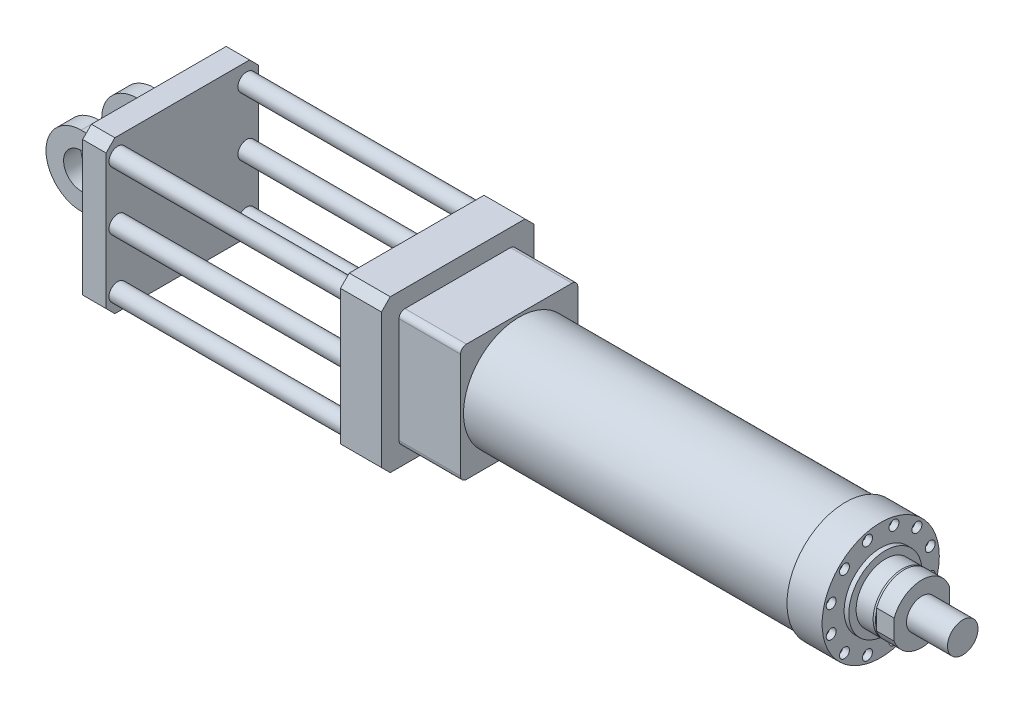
ISO-10303-21;
HEADER;
FILE_DESCRIPTION(('STEP AP214'),'2;1');
FILE_NAME('part.step','',(''),(''),'','','');
FILE_SCHEMA(('AUTOMOTIVE_DESIGN { 1 0 10303 214 1 1 1 1 }'));
ENDSEC;
DATA;
#1=APPLICATION_CONTEXT('core data for automotive mechanical design processes');
#2=APPLICATION_PROTOCOL_DEFINITION('international standard','automotive_design',2000,#1);
#3=PRODUCT_CONTEXT('',#1,'mechanical');
#4=PRODUCT('Part','Part','',(#3));
#5=PRODUCT_RELATED_PRODUCT_CATEGORY('part','',(#4));
#6=PRODUCT_DEFINITION_FORMATION('','',#4);
#7=PRODUCT_DEFINITION_CONTEXT('part definition',#1,'design');
#8=PRODUCT_DEFINITION('design','',#6,#7);
#9=PRODUCT_DEFINITION_SHAPE('','',#8);
#10=(LENGTH_UNIT() NAMED_UNIT(*) SI_UNIT(.MILLI.,.METRE.));
#11=(NAMED_UNIT(*) PLANE_ANGLE_UNIT() SI_UNIT($,.RADIAN.));
#12=(NAMED_UNIT(*) SI_UNIT($,.STERADIAN.) SOLID_ANGLE_UNIT());
#13=UNCERTAINTY_MEASURE_WITH_UNIT(LENGTH_MEASURE(1.E-05),#10,'distance_accuracy_value','');
#14=(GEOMETRIC_REPRESENTATION_CONTEXT(3) GLOBAL_UNCERTAINTY_ASSIGNED_CONTEXT((#13)) GLOBAL_UNIT_ASSIGNED_CONTEXT((#10,
#11,#12)) REPRESENTATION_CONTEXT('',''));
#15=CARTESIAN_POINT('',(0.,0.,0.));
#16=DIRECTION('',(0.,0.,1.));
#17=DIRECTION('',(1.,0.,0.));
#18=AXIS2_PLACEMENT_3D('',#15,#16,#17);
#19=CARTESIAN_POINT('',(-615.,0.,0.));
#20=DIRECTION('',(-1.,0.,0.));
#21=DIRECTION('',(0.,0.,1.));
#22=AXIS2_PLACEMENT_3D('',#19,#20,#21);
#23=PLANE('',#22);
#24=DIRECTION('',(0.,1.,0.));
#25=VECTOR('',#24,1.);
#26=CARTESIAN_POINT('',(-615.,0.,-72.5));
#27=LINE('',#26,#25);
#28=CARTESIAN_POINT('',(-615.,-70.,-72.5));
#29=VERTEX_POINT('',#28);
#30=CARTESIAN_POINT('',(-615.,70.,-72.5));
#31=VERTEX_POINT('',#30);
#32=EDGE_CURVE('E267',#29,#31,#27,.T.);
#33=ORIENTED_EDGE('',*,*,#32,.T.);
#34=DIRECTION('',(0.,0.,1.));
#35=VECTOR('',#34,1.);
#36=CARTESIAN_POINT('',(-615.,70.,0.));
#37=LINE('',#36,#35);
#38=CARTESIAN_POINT('',(-615.,70.,-22.5));
#39=VERTEX_POINT('',#38);
#40=EDGE_CURVE('E271',#31,#39,#37,.T.);
#41=ORIENTED_EDGE('',*,*,#40,.T.);
#42=DIRECTION('',(0.,-1.,0.));
#43=VECTOR('',#42,1.);
#44=CARTESIAN_POINT('',(-615.,0.,-22.5));
#45=LINE('',#44,#43);
#46=CARTESIAN_POINT('',(-615.,-70.,-22.5));
#47=VERTEX_POINT('',#46);
#48=EDGE_CURVE('E269',#39,#47,#45,.T.);
#49=ORIENTED_EDGE('',*,*,#48,.T.);
#50=DIRECTION('',(0.,0.,-1.));
#51=VECTOR('',#50,1.);
#52=CARTESIAN_POINT('',(-615.,-70.,0.));
#53=LINE('',#52,#51);
#54=EDGE_CURVE('E265',#47,#29,#53,.T.);
#55=ORIENTED_EDGE('',*,*,#54,.T.);
#56=EDGE_LOOP('',(#33,#41,#49,#55));
#57=FACE_BOUND('',#56,.T.);
#58=DIRECTION('',(0.,0.,-1.));
#59=VECTOR('',#58,1.);
#60=CARTESIAN_POINT('',(-615.,-70.,0.));
#61=LINE('',#60,#59);
#62=CARTESIAN_POINT('',(-615.,-70.,72.5000000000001));
#63=VERTEX_POINT('',#62);
#64=CARTESIAN_POINT('',(-615.,-70.,22.5));
#65=VERTEX_POINT('',#64);
#66=EDGE_CURVE('E260',#63,#65,#61,.T.);
#67=ORIENTED_EDGE('',*,*,#66,.T.);
#68=DIRECTION('',(0.,1.,0.));
#69=VECTOR('',#68,1.);
#70=CARTESIAN_POINT('',(-615.,0.,22.5));
#71=LINE('',#70,#69);
#72=CARTESIAN_POINT('',(-615.,70.,22.5));
#73=VERTEX_POINT('',#72);
#74=EDGE_CURVE('E262',#65,#73,#71,.T.);
#75=ORIENTED_EDGE('',*,*,#74,.T.);
#76=DIRECTION('',(0.,0.,1.));
#77=VECTOR('',#76,1.);
#78=CARTESIAN_POINT('',(-615.,70.,0.));
#79=LINE('',#78,#77);
#80=CARTESIAN_POINT('',(-615.,70.,72.5));
#81=VERTEX_POINT('',#80);
#82=EDGE_CURVE('E256',#73,#81,#79,.T.);
#83=ORIENTED_EDGE('',*,*,#82,.T.);
#84=DIRECTION('',(0.,-1.,0.));
#85=VECTOR('',#84,1.);
#86=CARTESIAN_POINT('',(-615.,0.,72.5));
#87=LINE('',#86,#85);
#88=EDGE_CURVE('E258',#81,#63,#87,.T.);
#89=ORIENTED_EDGE('',*,*,#88,.T.);
#90=EDGE_LOOP('',(#67,#75,#83,#89));
#91=FACE_BOUND('',#90,.T.);
#92=DIRECTION('',(0.,-1.,0.));
#93=VECTOR('',#92,1.);
#94=CARTESIAN_POINT('',(-615.,130.,-130.));
#95=LINE('',#94,#93);
#96=CARTESIAN_POINT('',(-615.,115.,-130.));
#97=VERTEX_POINT('',#96);
#98=CARTESIAN_POINT('',(-615.,-115.,-130.));
#99=VERTEX_POINT('',#98);
#100=EDGE_CURVE('E233',#97,#99,#95,.T.);
#101=ORIENTED_EDGE('',*,*,#100,.T.);
#102=DIRECTION('',(0.,0.707106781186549,-0.707106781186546));
#103=VECTOR('',#102,1.);
#104=CARTESIAN_POINT('',(-615.,-122.5,-122.5));
#105=LINE('',#104,#103);
#106=CARTESIAN_POINT('',(-615.,-130.,-115.));
#107=VERTEX_POINT('',#106);
#108=EDGE_CURVE('E330',#99,#107,#105,.F.);
#109=ORIENTED_EDGE('',*,*,#108,.T.);
#110=DIRECTION('',(0.,0.,1.));
#111=VECTOR('',#110,1.);
#112=CARTESIAN_POINT('',(-615.,-130.,-130.));
#113=LINE('',#112,#111);
#114=CARTESIAN_POINT('',(-615.,-130.,115.));
#115=VERTEX_POINT('',#114);
#116=EDGE_CURVE('E236',#107,#115,#113,.T.);
#117=ORIENTED_EDGE('',*,*,#116,.T.);
#118=DIRECTION('',(0.,-0.707106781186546,-0.707106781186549));
#119=VECTOR('',#118,1.);
#120=CARTESIAN_POINT('',(-615.,-122.5,122.5));
#121=LINE('',#120,#119);
#122=CARTESIAN_POINT('',(-615.,-115.,130.));
#123=VERTEX_POINT('',#122);
#124=EDGE_CURVE('E328',#115,#123,#121,.F.);
#125=ORIENTED_EDGE('',*,*,#124,.T.);
#126=DIRECTION('',(0.,1.,0.));
#127=VECTOR('',#126,1.);
#128=CARTESIAN_POINT('',(-615.,130.,130.));
#129=LINE('',#128,#127);
#130=CARTESIAN_POINT('',(-615.,115.,130.));
#131=VERTEX_POINT('',#130);
#132=EDGE_CURVE('E228',#123,#131,#129,.T.);
#133=ORIENTED_EDGE('',*,*,#132,.T.);
#134=DIRECTION('',(0.,-0.707106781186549,0.707106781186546));
#135=VECTOR('',#134,1.);
#136=CARTESIAN_POINT('',(-615.,122.5,122.5));
#137=LINE('',#136,#135);
#138=CARTESIAN_POINT('',(-615.,130.,115.));
#139=VERTEX_POINT('',#138);
#140=EDGE_CURVE('E68',#131,#139,#137,.F.);
#141=ORIENTED_EDGE('',*,*,#140,.T.);
#142=DIRECTION('',(0.,0.,-1.));
#143=VECTOR('',#142,1.);
#144=CARTESIAN_POINT('',(-615.,130.,-130.));
#145=LINE('',#144,#143);
#146=CARTESIAN_POINT('',(-615.,130.,-115.));
#147=VERTEX_POINT('',#146);
#148=EDGE_CURVE('E230',#139,#147,#145,.T.);
#149=ORIENTED_EDGE('',*,*,#148,.T.);
#150=DIRECTION('',(0.,0.707106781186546,0.707106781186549));
#151=VECTOR('',#150,1.);
#152=CARTESIAN_POINT('',(-615.,122.5,-122.5));
#153=LINE('',#152,#151);
#154=EDGE_CURVE('E326',#147,#97,#153,.F.);
#155=ORIENTED_EDGE('',*,*,#154,.T.);
#156=EDGE_LOOP('',(#101,#109,#117,#125,#133,#141,#149,#155));
#157=FACE_BOUND('',#156,.T.);
#158=ADVANCED_FACE('F48',(#57,#91,#157),#23,.T.);
#159=CARTESIAN_POINT('',(-615.,130.,130.));
#160=DIRECTION('',(0.,0.,-1.));
#161=DIRECTION('',(0.,1.,0.));
#162=AXIS2_PLACEMENT_3D('',#159,#160,#161);
#163=PLANE('',#162);
#164=ORIENTED_EDGE('',*,*,#132,.F.);
#165=DIRECTION('',(1.,0.,0.));
#166=VECTOR('',#165,1.);
#167=CARTESIAN_POINT('',(-615.,-115.,130.));
#168=LINE('',#167,#166);
#169=CARTESIAN_POINT('',(-575.,-115.,130.));
#170=VERTEX_POINT('',#169);
#171=EDGE_CURVE('E334',#123,#170,#168,.T.);
#172=ORIENTED_EDGE('',*,*,#171,.T.);
#173=DIRECTION('',(0.,1.,0.));
#174=VECTOR('',#173,1.);
#175=CARTESIAN_POINT('',(-575.,130.,130.));
#176=LINE('',#175,#174);
#177=CARTESIAN_POINT('',(-575.,115.,130.));
#178=VERTEX_POINT('',#177);
#179=EDGE_CURVE('E227',#170,#178,#176,.T.);
#180=ORIENTED_EDGE('',*,*,#179,.T.);
#181=DIRECTION('',(-1.,0.,0.));
#182=VECTOR('',#181,1.);
#183=CARTESIAN_POINT('',(-615.,115.,130.));
#184=LINE('',#183,#182);
#185=EDGE_CURVE('E332',#178,#131,#184,.T.);
#186=ORIENTED_EDGE('',*,*,#185,.T.);
#187=EDGE_LOOP('',(#164,#172,#180,#186));
#188=FACE_BOUND('',#187,.T.);
#189=ADVANCED_FACE('F368',(#188),#163,.F.);
#190=CARTESIAN_POINT('',(-615.,130.,-130.));
#191=DIRECTION('',(0.,-1.,0.));
#192=DIRECTION('',(0.,0.,-1.));
#193=AXIS2_PLACEMENT_3D('',#190,#191,#192);
#194=PLANE('',#193);
#195=DIRECTION('',(0.,0.,-1.));
#196=VECTOR('',#195,1.);
#197=CARTESIAN_POINT('',(-575.,130.,-130.));
#198=LINE('',#197,#196);
#199=CARTESIAN_POINT('',(-575.,130.,115.));
#200=VERTEX_POINT('',#199);
#201=CARTESIAN_POINT('',(-575.,130.,-115.));
#202=VERTEX_POINT('',#201);
#203=EDGE_CURVE('E242',#200,#202,#198,.T.);
#204=ORIENTED_EDGE('',*,*,#203,.T.);
#205=DIRECTION('',(-1.,0.,0.));
#206=VECTOR('',#205,1.);
#207=CARTESIAN_POINT('',(-615.,130.,-115.));
#208=LINE('',#207,#206);
#209=EDGE_CURVE('E12',#202,#147,#208,.T.);
#210=ORIENTED_EDGE('',*,*,#209,.T.);
#211=ORIENTED_EDGE('',*,*,#148,.F.);
#212=DIRECTION('',(1.,0.,0.));
#213=VECTOR('',#212,1.);
#214=CARTESIAN_POINT('',(-615.,130.,115.));
#215=LINE('',#214,#213);
#216=EDGE_CURVE('E56',#139,#200,#215,.T.);
#217=ORIENTED_EDGE('',*,*,#216,.T.);
#218=EDGE_LOOP('',(#204,#210,#211,#217));
#219=FACE_BOUND('',#218,.T.);
#220=ADVANCED_FACE('F339',(#219),#194,.F.);
#221=CARTESIAN_POINT('',(-615.,130.,-130.));
#222=DIRECTION('',(0.,0.,1.));
#223=DIRECTION('',(0.,-1.,0.));
#224=AXIS2_PLACEMENT_3D('',#221,#222,#223);
#225=PLANE('',#224);
#226=DIRECTION('',(0.,-1.,0.));
#227=VECTOR('',#226,1.);
#228=CARTESIAN_POINT('',(-575.,130.,-130.));
#229=LINE('',#228,#227);
#230=CARTESIAN_POINT('',(-575.,115.,-130.));
#231=VERTEX_POINT('',#230);
#232=CARTESIAN_POINT('',(-575.,-115.,-130.));
#233=VERTEX_POINT('',#232);
#234=EDGE_CURVE('E244',#231,#233,#229,.T.);
#235=ORIENTED_EDGE('',*,*,#234,.T.);
#236=DIRECTION('',(-1.,0.,0.));
#237=VECTOR('',#236,1.);
#238=CARTESIAN_POINT('',(-615.,-115.,-130.));
#239=LINE('',#238,#237);
#240=EDGE_CURVE('E323',#233,#99,#239,.T.);
#241=ORIENTED_EDGE('',*,*,#240,.T.);
#242=ORIENTED_EDGE('',*,*,#100,.F.);
#243=DIRECTION('',(1.,0.,0.));
#244=VECTOR('',#243,1.);
#245=CARTESIAN_POINT('',(-615.,115.,-130.));
#246=LINE('',#245,#244);
#247=EDGE_CURVE('E320',#97,#231,#246,.T.);
#248=ORIENTED_EDGE('',*,*,#247,.T.);
#249=EDGE_LOOP('',(#235,#241,#242,#248));
#250=FACE_BOUND('',#249,.T.);
#251=ADVANCED_FACE('F352',(#250),#225,.F.);
#252=CARTESIAN_POINT('',(-615.,-130.,-130.));
#253=DIRECTION('',(0.,1.,0.));
#254=DIRECTION('',(0.,0.,1.));
#255=AXIS2_PLACEMENT_3D('',#252,#253,#254);
#256=PLANE('',#255);
#257=ORIENTED_EDGE('',*,*,#116,.F.);
#258=DIRECTION('',(1.,0.,0.));
#259=VECTOR('',#258,1.);
#260=CARTESIAN_POINT('',(-615.,-130.,-115.));
#261=LINE('',#260,#259);
#262=CARTESIAN_POINT('',(-575.,-130.,-115.));
#263=VERTEX_POINT('',#262);
#264=EDGE_CURVE('E309',#107,#263,#261,.T.);
#265=ORIENTED_EDGE('',*,*,#264,.T.);
#266=DIRECTION('',(0.,0.,1.));
#267=VECTOR('',#266,1.);
#268=CARTESIAN_POINT('',(-575.,-130.,-130.));
#269=LINE('',#268,#267);
#270=CARTESIAN_POINT('',(-575.,-130.,115.));
#271=VERTEX_POINT('',#270);
#272=EDGE_CURVE('E231',#263,#271,#269,.T.);
#273=ORIENTED_EDGE('',*,*,#272,.T.);
#274=DIRECTION('',(-1.,0.,0.));
#275=VECTOR('',#274,1.);
#276=CARTESIAN_POINT('',(-615.,-130.,115.));
#277=LINE('',#276,#275);
#278=EDGE_CURVE('E288',#271,#115,#277,.T.);
#279=ORIENTED_EDGE('',*,*,#278,.T.);
#280=EDGE_LOOP('',(#257,#265,#273,#279));
#281=FACE_BOUND('',#280,.T.);
#282=ADVANCED_FACE('F360',(#281),#256,.F.);
#283=CARTESIAN_POINT('',(-575.,0.,0.));
#284=DIRECTION('',(-1.,0.,0.));
#285=DIRECTION('',(0.,0.,1.));
#286=AXIS2_PLACEMENT_3D('',#283,#284,#285);
#287=PLANE('',#286);
#288=ORIENTED_EDGE('',*,*,#272,.F.);
#289=DIRECTION('',(0.,-0.707106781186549,0.707106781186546));
#290=VECTOR('',#289,1.);
#291=CARTESIAN_POINT('',(-575.,-130.,-115.));
#292=LINE('',#291,#290);
#293=EDGE_CURVE('E318',#263,#233,#292,.F.);
#294=ORIENTED_EDGE('',*,*,#293,.T.);
#295=ORIENTED_EDGE('',*,*,#234,.F.);
#296=DIRECTION('',(0.,-0.707106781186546,-0.707106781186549));
#297=VECTOR('',#296,1.);
#298=CARTESIAN_POINT('',(-575.,115.,-130.));
#299=LINE('',#298,#297);
#300=EDGE_CURVE('E314',#231,#202,#299,.F.);
#301=ORIENTED_EDGE('',*,*,#300,.T.);
#302=ORIENTED_EDGE('',*,*,#203,.F.);
#303=DIRECTION('',(0.,0.707106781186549,-0.707106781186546));
#304=VECTOR('',#303,1.);
#305=CARTESIAN_POINT('',(-575.,130.,115.));
#306=LINE('',#305,#304);
#307=EDGE_CURVE('E312',#200,#178,#306,.F.);
#308=ORIENTED_EDGE('',*,*,#307,.T.);
#309=ORIENTED_EDGE('',*,*,#179,.F.);
#310=DIRECTION('',(0.,0.707106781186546,0.707106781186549));
#311=VECTOR('',#310,1.);
#312=CARTESIAN_POINT('',(-575.,-115.,130.));
#313=LINE('',#312,#311);
#314=EDGE_CURVE('E316',#170,#271,#313,.F.);
#315=ORIENTED_EDGE('',*,*,#314,.T.);
#316=EDGE_LOOP('',(#288,#294,#295,#301,#302,#308,#309,#315));
#317=FACE_BOUND('',#316,.T.);
#318=ADVANCED_FACE('F343',(#317),#287,.F.);
#319=CARTESIAN_POINT('',(-745.,60.,-32.5));
#320=DIRECTION('',(0.,0.,-1.));
#321=DIRECTION('',(0.,1.,0.));
#322=AXIS2_PLACEMENT_3D('',#319,#320,#321);
#323=PLANE('',#322);
#324=CARTESIAN_POINT('',(-685.,0.,-32.5));
#325=DIRECTION('',(0.,0.,-1.));
#326=DIRECTION('',(0.,1.,0.));
#327=AXIS2_PLACEMENT_3D('',#324,#325,#326);
#328=CIRCLE('',#327,30.);
#329=CARTESIAN_POINT('',(-685.,30.0000000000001,-32.5));
#330=VERTEX_POINT('',#329);
#331=EDGE_CURVE('E646',#330,#330,#328,.T.);
#332=ORIENTED_EDGE('',*,*,#331,.T.);
#333=EDGE_LOOP('',(#332));
#334=FACE_BOUND('',#333,.T.);
#335=DIRECTION('',(1.,0.,0.));
#336=VECTOR('',#335,1.);
#337=CARTESIAN_POINT('',(-745.,-60.,-32.5));
#338=LINE('',#337,#336);
#339=CARTESIAN_POINT('',(-685.,-59.9999999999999,-32.5));
#340=VERTEX_POINT('',#339);
#341=CARTESIAN_POINT('',(-625.,-60.,-32.5));
#342=VERTEX_POINT('',#341);
#343=EDGE_CURVE('E210',#340,#342,#338,.T.);
#344=ORIENTED_EDGE('',*,*,#343,.T.);
#345=DIRECTION('',(0.,1.,0.));
#346=VECTOR('',#345,1.);
#347=CARTESIAN_POINT('',(-625.,60.,-32.5));
#348=LINE('',#347,#346);
#349=CARTESIAN_POINT('',(-625.,60.,-32.5));
#350=VERTEX_POINT('',#349);
#351=EDGE_CURVE('E274',#342,#350,#348,.T.);
#352=ORIENTED_EDGE('',*,*,#351,.T.);
#353=DIRECTION('',(1.,0.,0.));
#354=VECTOR('',#353,1.);
#355=CARTESIAN_POINT('',(-745.,60.,-32.5));
#356=LINE('',#355,#354);
#357=CARTESIAN_POINT('',(-685.,60.,-32.5));
#358=VERTEX_POINT('',#357);
#359=EDGE_CURVE('E224',#358,#350,#356,.T.);
#360=ORIENTED_EDGE('',*,*,#359,.F.);
#361=CARTESIAN_POINT('',(-685.,0.,-32.5));
#362=DIRECTION('',(0.,0.,-1.));
#363=DIRECTION('',(0.,1.,0.));
#364=AXIS2_PLACEMENT_3D('',#361,#362,#363);
#365=CIRCLE('',#364,59.9999999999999);
#366=EDGE_CURVE('E253',#358,#340,#365,.F.);
#367=ORIENTED_EDGE('',*,*,#366,.T.);
#368=EDGE_LOOP('',(#344,#352,#360,#367));
#369=FACE_BOUND('',#368,.T.);
#370=ADVANCED_FACE('F384',(#334,#369),#323,.F.);
#371=CARTESIAN_POINT('',(-745.,60.,-62.5));
#372=DIRECTION('',(0.,-1.,0.));
#373=DIRECTION('',(0.,0.,-1.));
#374=AXIS2_PLACEMENT_3D('',#371,#372,#373);
#375=PLANE('',#374);
#376=ORIENTED_EDGE('',*,*,#359,.T.);
#377=DIRECTION('',(0.,0.,-1.));
#378=VECTOR('',#377,1.);
#379=CARTESIAN_POINT('',(-625.,60.,-62.5));
#380=LINE('',#379,#378);
#381=CARTESIAN_POINT('',(-625.,60.,-62.5));
#382=VERTEX_POINT('',#381);
#383=EDGE_CURVE('E239',#350,#382,#380,.T.);
#384=ORIENTED_EDGE('',*,*,#383,.T.);
#385=DIRECTION('',(1.,0.,0.));
#386=VECTOR('',#385,1.);
#387=CARTESIAN_POINT('',(-745.,60.,-62.5));
#388=LINE('',#387,#386);
#389=CARTESIAN_POINT('',(-685.,60.,-62.5));
#390=VERTEX_POINT('',#389);
#391=EDGE_CURVE('E221',#390,#382,#388,.T.);
#392=ORIENTED_EDGE('',*,*,#391,.F.);
#393=DIRECTION('',(0.,0.,1.));
#394=VECTOR('',#393,1.);
#395=CARTESIAN_POINT('',(-685.,60.,-67.5));
#396=LINE('',#395,#394);
#397=EDGE_CURVE('E205',#390,#358,#396,.T.);
#398=ORIENTED_EDGE('',*,*,#397,.T.);
#399=EDGE_LOOP('',(#376,#384,#392,#398));
#400=FACE_BOUND('',#399,.T.);
#401=ADVANCED_FACE('F574',(#400),#375,.F.);
#402=CARTESIAN_POINT('',(-745.,60.,-62.5));
#403=DIRECTION('',(0.,0.,1.));
#404=DIRECTION('',(0.,-1.,0.));
#405=AXIS2_PLACEMENT_3D('',#402,#403,#404);
#406=PLANE('',#405);
#407=CARTESIAN_POINT('',(-685.,0.,-62.5));
#408=DIRECTION('',(0.,0.,1.));
#409=DIRECTION('',(0.,-1.,0.));
#410=AXIS2_PLACEMENT_3D('',#407,#408,#409);
#411=CIRCLE('',#410,30.);
#412=CARTESIAN_POINT('',(-685.,-30.,-62.5));
#413=VERTEX_POINT('',#412);
#414=EDGE_CURVE('E252',#413,#413,#411,.T.);
#415=ORIENTED_EDGE('',*,*,#414,.T.);
#416=EDGE_LOOP('',(#415));
#417=FACE_BOUND('',#416,.T.);
#418=ORIENTED_EDGE('',*,*,#391,.T.);
#419=DIRECTION('',(0.,-1.,0.));
#420=VECTOR('',#419,1.);
#421=CARTESIAN_POINT('',(-625.,60.,-62.5));
#422=LINE('',#421,#420);
#423=CARTESIAN_POINT('',(-625.,-60.,-62.5));
#424=VERTEX_POINT('',#423);
#425=EDGE_CURVE('E276',#382,#424,#422,.T.);
#426=ORIENTED_EDGE('',*,*,#425,.T.);
#427=DIRECTION('',(1.,0.,0.));
#428=VECTOR('',#427,1.);
#429=CARTESIAN_POINT('',(-745.,-60.,-62.5));
#430=LINE('',#429,#428);
#431=CARTESIAN_POINT('',(-685.,-60.,-62.5));
#432=VERTEX_POINT('',#431);
#433=EDGE_CURVE('E213',#432,#424,#430,.T.);
#434=ORIENTED_EDGE('',*,*,#433,.F.);
#435=CARTESIAN_POINT('',(-685.,0.,-62.5));
#436=DIRECTION('',(0.,0.,1.));
#437=DIRECTION('',(0.,-1.,0.));
#438=AXIS2_PLACEMENT_3D('',#435,#436,#437);
#439=CIRCLE('',#438,59.9999999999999);
#440=EDGE_CURVE('E667',#432,#390,#439,.F.);
#441=ORIENTED_EDGE('',*,*,#440,.T.);
#442=EDGE_LOOP('',(#418,#426,#434,#441));
#443=FACE_BOUND('',#442,.T.);
#444=ADVANCED_FACE('F565',(#417,#443),#406,.F.);
#445=CARTESIAN_POINT('',(-745.,-60.,-62.5));
#446=DIRECTION('',(0.,1.,0.));
#447=DIRECTION('',(0.,0.,1.));
#448=AXIS2_PLACEMENT_3D('',#445,#446,#447);
#449=PLANE('',#448);
#450=ORIENTED_EDGE('',*,*,#433,.T.);
#451=DIRECTION('',(0.,0.,1.));
#452=VECTOR('',#451,1.);
#453=CARTESIAN_POINT('',(-625.,-60.,-62.5));
#454=LINE('',#453,#452);
#455=EDGE_CURVE('E278',#424,#342,#454,.T.);
#456=ORIENTED_EDGE('',*,*,#455,.T.);
#457=ORIENTED_EDGE('',*,*,#343,.F.);
#458=DIRECTION('',(0.,0.,1.));
#459=VECTOR('',#458,1.);
#460=CARTESIAN_POINT('',(-685.,-59.9999999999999,-67.5));
#461=LINE('',#460,#459);
#462=EDGE_CURVE('E692',#432,#340,#461,.T.);
#463=ORIENTED_EDGE('',*,*,#462,.F.);
#464=EDGE_LOOP('',(#450,#456,#457,#463));
#465=FACE_BOUND('',#464,.T.);
#466=ADVANCED_FACE('F556',(#465),#449,.F.);
#467=CARTESIAN_POINT('',(-745.,60.,62.5));
#468=DIRECTION('',(0.,0.,-1.));
#469=DIRECTION('',(0.,1.,0.));
#470=AXIS2_PLACEMENT_3D('',#467,#468,#469);
#471=PLANE('',#470);
#472=CARTESIAN_POINT('',(-685.,0.,62.5));
#473=DIRECTION('',(0.,0.,1.));
#474=DIRECTION('',(1.,0.,0.));
#475=AXIS2_PLACEMENT_3D('',#472,#473,#474);
#476=CIRCLE('',#475,30.);
#477=CARTESIAN_POINT('',(-655.,0.,62.5));
#478=VERTEX_POINT('',#477);
#479=EDGE_CURVE('E671',#478,#478,#476,.T.);
#480=ORIENTED_EDGE('',*,*,#479,.F.);
#481=EDGE_LOOP('',(#480));
#482=FACE_BOUND('',#481,.T.);
#483=DIRECTION('',(1.,0.,0.));
#484=VECTOR('',#483,1.);
#485=CARTESIAN_POINT('',(-745.,-60.,62.5));
#486=LINE('',#485,#484);
#487=CARTESIAN_POINT('',(-685.,-59.9999999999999,62.5));
#488=VERTEX_POINT('',#487);
#489=CARTESIAN_POINT('',(-625.,-60.,62.5));
#490=VERTEX_POINT('',#489);
#491=EDGE_CURVE('E678',#488,#490,#486,.T.);
#492=ORIENTED_EDGE('',*,*,#491,.T.);
#493=DIRECTION('',(0.,1.,0.));
#494=VECTOR('',#493,1.);
#495=CARTESIAN_POINT('',(-625.,60.,62.5));
#496=LINE('',#495,#494);
#497=CARTESIAN_POINT('',(-625.,60.,62.5));
#498=VERTEX_POINT('',#497);
#499=EDGE_CURVE('E209',#490,#498,#496,.T.);
#500=ORIENTED_EDGE('',*,*,#499,.T.);
#501=DIRECTION('',(1.,0.,0.));
#502=VECTOR('',#501,1.);
#503=CARTESIAN_POINT('',(-745.,60.,62.5));
#504=LINE('',#503,#502);
#505=CARTESIAN_POINT('',(-685.,60.,62.5));
#506=VERTEX_POINT('',#505);
#507=EDGE_CURVE('E201',#506,#498,#504,.T.);
#508=ORIENTED_EDGE('',*,*,#507,.F.);
#509=CARTESIAN_POINT('',(-685.,0.,62.5));
#510=DIRECTION('',(0.,0.,-1.));
#511=DIRECTION('',(1.,0.,0.));
#512=AXIS2_PLACEMENT_3D('',#509,#510,#511);
#513=CIRCLE('',#512,59.9999999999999);
#514=EDGE_CURVE('E185',#488,#506,#513,.T.);
#515=ORIENTED_EDGE('',*,*,#514,.F.);
#516=EDGE_LOOP('',(#492,#500,#508,#515));
#517=FACE_BOUND('',#516,.T.);
#518=ADVANCED_FACE('F207',(#482,#517),#471,.F.);
#519=CARTESIAN_POINT('',(-745.,60.,32.5));
#520=DIRECTION('',(0.,-1.,0.));
#521=DIRECTION('',(0.,0.,-1.));
#522=AXIS2_PLACEMENT_3D('',#519,#520,#521);
#523=PLANE('',#522);
#524=ORIENTED_EDGE('',*,*,#507,.T.);
#525=DIRECTION('',(0.,0.,-1.));
#526=VECTOR('',#525,1.);
#527=CARTESIAN_POINT('',(-625.,60.,32.5));
#528=LINE('',#527,#526);
#529=CARTESIAN_POINT('',(-625.,60.,32.5));
#530=VERTEX_POINT('',#529);
#531=EDGE_CURVE('E286',#498,#530,#528,.T.);
#532=ORIENTED_EDGE('',*,*,#531,.T.);
#533=DIRECTION('',(1.,0.,0.));
#534=VECTOR('',#533,1.);
#535=CARTESIAN_POINT('',(-745.,60.,32.5));
#536=LINE('',#535,#534);
#537=CARTESIAN_POINT('',(-685.,60.,32.5));
#538=VERTEX_POINT('',#537);
#539=EDGE_CURVE('E204',#538,#530,#536,.T.);
#540=ORIENTED_EDGE('',*,*,#539,.F.);
#541=EDGE_CURVE('E188',#538,#506,#396,.T.);
#542=ORIENTED_EDGE('',*,*,#541,.T.);
#543=EDGE_LOOP('',(#524,#532,#540,#542));
#544=FACE_BOUND('',#543,.T.);
#545=ADVANCED_FACE('F200',(#544),#523,.F.);
#546=CARTESIAN_POINT('',(-745.,60.,32.5));
#547=DIRECTION('',(0.,0.,1.));
#548=DIRECTION('',(0.,-1.,0.));
#549=AXIS2_PLACEMENT_3D('',#546,#547,#548);
#550=PLANE('',#549);
#551=CARTESIAN_POINT('',(-685.,0.,32.5));
#552=DIRECTION('',(0.,0.,1.));
#553=DIRECTION('',(0.,-1.,0.));
#554=AXIS2_PLACEMENT_3D('',#551,#552,#553);
#555=CIRCLE('',#554,30.);
#556=CARTESIAN_POINT('',(-685.,-30.,32.5));
#557=VERTEX_POINT('',#556);
#558=EDGE_CURVE('E249',#557,#557,#555,.T.);
#559=ORIENTED_EDGE('',*,*,#558,.T.);
#560=EDGE_LOOP('',(#559));
#561=FACE_BOUND('',#560,.T.);
#562=ORIENTED_EDGE('',*,*,#539,.T.);
#563=DIRECTION('',(0.,-1.,0.));
#564=VECTOR('',#563,1.);
#565=CARTESIAN_POINT('',(-625.,60.,32.5));
#566=LINE('',#565,#564);
#567=CARTESIAN_POINT('',(-625.,-60.,32.5));
#568=VERTEX_POINT('',#567);
#569=EDGE_CURVE('E280',#530,#568,#566,.T.);
#570=ORIENTED_EDGE('',*,*,#569,.T.);
#571=DIRECTION('',(1.,0.,0.));
#572=VECTOR('',#571,1.);
#573=CARTESIAN_POINT('',(-745.,-60.,32.5));
#574=LINE('',#573,#572);
#575=CARTESIAN_POINT('',(-685.,-60.,32.5));
#576=VERTEX_POINT('',#575);
#577=EDGE_CURVE('E215',#576,#568,#574,.T.);
#578=ORIENTED_EDGE('',*,*,#577,.F.);
#579=CARTESIAN_POINT('',(-685.,0.,32.5));
#580=DIRECTION('',(0.,0.,1.));
#581=DIRECTION('',(0.,-1.,0.));
#582=AXIS2_PLACEMENT_3D('',#579,#580,#581);
#583=CIRCLE('',#582,59.9999999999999);
#584=EDGE_CURVE('E668',#576,#538,#583,.F.);
#585=ORIENTED_EDGE('',*,*,#584,.T.);
#586=EDGE_LOOP('',(#562,#570,#578,#585));
#587=FACE_BOUND('',#586,.T.);
#588=ADVANCED_FACE('F532',(#561,#587),#550,.F.);
#589=CARTESIAN_POINT('',(-745.,-60.,32.5));
#590=DIRECTION('',(0.,1.,0.));
#591=DIRECTION('',(0.,0.,1.));
#592=AXIS2_PLACEMENT_3D('',#589,#590,#591);
#593=PLANE('',#592);
#594=ORIENTED_EDGE('',*,*,#577,.T.);
#595=DIRECTION('',(0.,0.,1.));
#596=VECTOR('',#595,1.);
#597=CARTESIAN_POINT('',(-625.,-60.,32.5));
#598=LINE('',#597,#596);
#599=EDGE_CURVE('E283',#568,#490,#598,.T.);
#600=ORIENTED_EDGE('',*,*,#599,.T.);
#601=ORIENTED_EDGE('',*,*,#491,.F.);
#602=EDGE_CURVE('E191',#576,#488,#461,.T.);
#603=ORIENTED_EDGE('',*,*,#602,.F.);
#604=EDGE_LOOP('',(#594,#600,#601,#603));
#605=FACE_BOUND('',#604,.T.);
#606=ADVANCED_FACE('F526',(#605),#593,.F.);
#607=CARTESIAN_POINT('',(-685.,0.,-67.5));
#608=DIRECTION('',(0.,0.,1.));
#609=DIRECTION('',(1.,0.,0.));
#610=AXIS2_PLACEMENT_3D('',#607,#608,#609);
#611=CYLINDRICAL_SURFACE('',#610,59.9999999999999);
#612=ORIENTED_EDGE('',*,*,#602,.T.);
#613=ORIENTED_EDGE('',*,*,#514,.T.);
#614=ORIENTED_EDGE('',*,*,#541,.F.);
#615=ORIENTED_EDGE('',*,*,#584,.F.);
#616=EDGE_LOOP('',(#612,#613,#614,#615));
#617=FACE_BOUND('',#616,.T.);
#618=ADVANCED_FACE('F187',(#617),#611,.T.);
#619=CARTESIAN_POINT('',(-685.,0.,-67.5));
#620=DIRECTION('',(0.,0.,1.));
#621=DIRECTION('',(1.,0.,0.));
#622=AXIS2_PLACEMENT_3D('',#619,#620,#621);
#623=CYLINDRICAL_SURFACE('',#622,30.);
#624=ORIENTED_EDGE('',*,*,#479,.T.);
#625=EDGE_LOOP('',(#624));
#626=FACE_BOUND('',#625,.T.);
#627=ORIENTED_EDGE('',*,*,#558,.F.);
#628=EDGE_LOOP('',(#627));
#629=FACE_BOUND('',#628,.T.);
#630=ADVANCED_FACE('F503',(#626,#629),#623,.F.);
#631=ORIENTED_EDGE('',*,*,#397,.F.);
#632=ORIENTED_EDGE('',*,*,#440,.F.);
#633=ORIENTED_EDGE('',*,*,#462,.T.);
#634=ORIENTED_EDGE('',*,*,#366,.F.);
#635=EDGE_LOOP('',(#631,#632,#633,#634));
#636=FACE_BOUND('',#635,.T.);
#637=ADVANCED_FACE('F500',(#636),#611,.T.);
#638=ORIENTED_EDGE('',*,*,#414,.F.);
#639=EDGE_LOOP('',(#638));
#640=FACE_BOUND('',#639,.T.);
#641=ORIENTED_EDGE('',*,*,#331,.F.);
#642=EDGE_LOOP('',(#641));
#643=FACE_BOUND('',#642,.T.);
#644=ADVANCED_FACE('F410',(#640,#643),#623,.F.);
#645=CARTESIAN_POINT('',(-625.,-60.,-62.5));
#646=DIRECTION('',(0.707106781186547,0.707106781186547,0.));
#647=DIRECTION('',(0.,0.,1.));
#648=AXIS2_PLACEMENT_3D('',#645,#646,#647);
#649=PLANE('',#648);
#650=DIRECTION('',(0.577350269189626,-0.577350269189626,-0.577350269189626));
#651=VECTOR('',#650,1.);
#652=CARTESIAN_POINT('',(-625.,-60.,-62.5));
#653=LINE('',#652,#651);
#654=EDGE_CURVE('E294',#29,#424,#653,.F.);
#655=ORIENTED_EDGE('',*,*,#654,.F.);
#656=ORIENTED_EDGE('',*,*,#54,.F.);
#657=DIRECTION('',(-0.577350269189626,0.577350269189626,-0.577350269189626));
#658=VECTOR('',#657,1.);
#659=CARTESIAN_POINT('',(-635.,-50.,-42.5));
#660=LINE('',#659,#658);
#661=EDGE_CURVE('E196',#342,#47,#660,.F.);
#662=ORIENTED_EDGE('',*,*,#661,.F.);
#663=ORIENTED_EDGE('',*,*,#455,.F.);
#664=EDGE_LOOP('',(#655,#656,#662,#663));
#665=FACE_BOUND('',#664,.T.);
#666=ADVANCED_FACE('F406',(#665),#649,.F.);
#667=CARTESIAN_POINT('',(-625.,60.,-32.5));
#668=DIRECTION('',(0.707106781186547,0.,-0.707106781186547));
#669=DIRECTION('',(0.,1.,0.));
#670=AXIS2_PLACEMENT_3D('',#667,#668,#669);
#671=PLANE('',#670);
#672=ORIENTED_EDGE('',*,*,#661,.T.);
#673=ORIENTED_EDGE('',*,*,#48,.F.);
#674=DIRECTION('',(-0.577350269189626,-0.577350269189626,-0.577350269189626));
#675=VECTOR('',#674,1.);
#676=CARTESIAN_POINT('',(-625.,60.,-32.5));
#677=LINE('',#676,#675);
#678=EDGE_CURVE('E291',#350,#39,#677,.F.);
#679=ORIENTED_EDGE('',*,*,#678,.F.);
#680=ORIENTED_EDGE('',*,*,#351,.F.);
#681=EDGE_LOOP('',(#672,#673,#679,#680));
#682=FACE_BOUND('',#681,.T.);
#683=ADVANCED_FACE('F402',(#682),#671,.F.);
#684=CARTESIAN_POINT('',(-625.,60.,-62.5));
#685=DIRECTION('',(0.707106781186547,0.,0.707106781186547));
#686=DIRECTION('',(0.,-1.,0.));
#687=AXIS2_PLACEMENT_3D('',#684,#685,#686);
#688=PLANE('',#687);
#689=ORIENTED_EDGE('',*,*,#654,.T.);
#690=ORIENTED_EDGE('',*,*,#425,.F.);
#691=DIRECTION('',(0.577350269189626,0.577350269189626,-0.577350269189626));
#692=VECTOR('',#691,1.);
#693=CARTESIAN_POINT('',(-625.,60.,-62.5));
#694=LINE('',#693,#692);
#695=EDGE_CURVE('E289',#31,#382,#694,.F.);
#696=ORIENTED_EDGE('',*,*,#695,.F.);
#697=ORIENTED_EDGE('',*,*,#32,.F.);
#698=EDGE_LOOP('',(#689,#690,#696,#697));
#699=FACE_BOUND('',#698,.T.);
#700=ADVANCED_FACE('F398',(#699),#688,.F.);
#701=CARTESIAN_POINT('',(-625.,60.,-62.5));
#702=DIRECTION('',(0.707106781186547,-0.707106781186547,0.));
#703=DIRECTION('',(0.,0.,-1.));
#704=AXIS2_PLACEMENT_3D('',#701,#702,#703);
#705=PLANE('',#704);
#706=ORIENTED_EDGE('',*,*,#678,.T.);
#707=ORIENTED_EDGE('',*,*,#40,.F.);
#708=ORIENTED_EDGE('',*,*,#695,.T.);
#709=ORIENTED_EDGE('',*,*,#383,.F.);
#710=EDGE_LOOP('',(#706,#707,#708,#709));
#711=FACE_BOUND('',#710,.T.);
#712=ADVANCED_FACE('F394',(#711),#705,.F.);
#713=CARTESIAN_POINT('',(-625.,60.,62.5));
#714=DIRECTION('',(0.707106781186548,0.,-0.707106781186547));
#715=DIRECTION('',(0.,1.,0.));
#716=AXIS2_PLACEMENT_3D('',#713,#714,#715);
#717=PLANE('',#716);
#718=DIRECTION('',(0.577350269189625,-0.577350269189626,0.577350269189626));
#719=VECTOR('',#718,1.);
#720=CARTESIAN_POINT('',(-665.,-20.,22.5));
#721=LINE('',#720,#719);
#722=EDGE_CURVE('E303',#63,#490,#721,.F.);
#723=ORIENTED_EDGE('',*,*,#722,.F.);
#724=ORIENTED_EDGE('',*,*,#88,.F.);
#725=DIRECTION('',(0.577350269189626,0.577350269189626,0.577350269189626));
#726=VECTOR('',#725,1.);
#727=CARTESIAN_POINT('',(-635.,50.,52.5));
#728=LINE('',#727,#726);
#729=EDGE_CURVE('E292',#498,#81,#728,.T.);
#730=ORIENTED_EDGE('',*,*,#729,.F.);
#731=ORIENTED_EDGE('',*,*,#499,.F.);
#732=EDGE_LOOP('',(#723,#724,#730,#731));
#733=FACE_BOUND('',#732,.T.);
#734=ADVANCED_FACE('F397',(#733),#717,.F.);
#735=CARTESIAN_POINT('',(-625.,60.,32.5));
#736=DIRECTION('',(0.707106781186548,-0.707106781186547,0.));
#737=DIRECTION('',(0.,0.,-1.));
#738=AXIS2_PLACEMENT_3D('',#735,#736,#737);
#739=PLANE('',#738);
#740=ORIENTED_EDGE('',*,*,#729,.T.);
#741=ORIENTED_EDGE('',*,*,#82,.F.);
#742=DIRECTION('',(-0.577350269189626,-0.577350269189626,0.577350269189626));
#743=VECTOR('',#742,1.);
#744=CARTESIAN_POINT('',(-625.,60.,32.5));
#745=LINE('',#744,#743);
#746=EDGE_CURVE('E301',#530,#73,#745,.F.);
#747=ORIENTED_EDGE('',*,*,#746,.F.);
#748=ORIENTED_EDGE('',*,*,#531,.F.);
#749=EDGE_LOOP('',(#740,#741,#747,#748));
#750=FACE_BOUND('',#749,.T.);
#751=ADVANCED_FACE('F419',(#750),#739,.F.);
#752=CARTESIAN_POINT('',(-625.,-60.,32.5));
#753=DIRECTION('',(0.707106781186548,0.707106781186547,0.));
#754=DIRECTION('',(0.,0.,1.));
#755=AXIS2_PLACEMENT_3D('',#752,#753,#754);
#756=PLANE('',#755);
#757=ORIENTED_EDGE('',*,*,#722,.T.);
#758=ORIENTED_EDGE('',*,*,#599,.F.);
#759=DIRECTION('',(0.577350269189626,-0.577350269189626,-0.577350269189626));
#760=VECTOR('',#759,1.);
#761=CARTESIAN_POINT('',(-625.,-60.,32.5));
#762=LINE('',#761,#760);
#763=EDGE_CURVE('E299',#65,#568,#762,.F.);
#764=ORIENTED_EDGE('',*,*,#763,.F.);
#765=ORIENTED_EDGE('',*,*,#66,.F.);
#766=EDGE_LOOP('',(#757,#758,#764,#765));
#767=FACE_BOUND('',#766,.T.);
#768=ADVANCED_FACE('F415',(#767),#756,.F.);
#769=CARTESIAN_POINT('',(-625.,60.,32.5));
#770=DIRECTION('',(0.707106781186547,0.,0.707106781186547));
#771=DIRECTION('',(0.,-1.,0.));
#772=AXIS2_PLACEMENT_3D('',#769,#770,#771);
#773=PLANE('',#772);
#774=ORIENTED_EDGE('',*,*,#746,.T.);
#775=ORIENTED_EDGE('',*,*,#74,.F.);
#776=ORIENTED_EDGE('',*,*,#763,.T.);
#777=ORIENTED_EDGE('',*,*,#569,.F.);
#778=EDGE_LOOP('',(#774,#775,#776,#777));
#779=FACE_BOUND('',#778,.T.);
#780=ADVANCED_FACE('F412',(#779),#773,.F.);
#781=CARTESIAN_POINT('',(-615.,-130.,-115.));
#782=DIRECTION('',(0.,0.707106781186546,0.707106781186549));
#783=DIRECTION('',(1.,0.,0.));
#784=AXIS2_PLACEMENT_3D('',#781,#782,#783);
#785=PLANE('',#784);
#786=ORIENTED_EDGE('',*,*,#108,.F.);
#787=ORIENTED_EDGE('',*,*,#240,.F.);
#788=ORIENTED_EDGE('',*,*,#293,.F.);
#789=ORIENTED_EDGE('',*,*,#264,.F.);
#790=EDGE_LOOP('',(#786,#787,#788,#789));
#791=FACE_BOUND('',#790,.T.);
#792=ADVANCED_FACE('F358',(#791),#785,.F.);
#793=CARTESIAN_POINT('',(-615.,-115.,130.));
#794=DIRECTION('',(0.,0.707106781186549,-0.707106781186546));
#795=DIRECTION('',(1.,0.,0.));
#796=AXIS2_PLACEMENT_3D('',#793,#794,#795);
#797=PLANE('',#796);
#798=ORIENTED_EDGE('',*,*,#124,.F.);
#799=ORIENTED_EDGE('',*,*,#278,.F.);
#800=ORIENTED_EDGE('',*,*,#314,.F.);
#801=ORIENTED_EDGE('',*,*,#171,.F.);
#802=EDGE_LOOP('',(#798,#799,#800,#801));
#803=FACE_BOUND('',#802,.T.);
#804=ADVANCED_FACE('F365',(#803),#797,.F.);
#805=CARTESIAN_POINT('',(-615.,115.,-130.));
#806=DIRECTION('',(0.,-0.707106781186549,0.707106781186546));
#807=DIRECTION('',(1.,0.,0.));
#808=AXIS2_PLACEMENT_3D('',#805,#806,#807);
#809=PLANE('',#808);
#810=ORIENTED_EDGE('',*,*,#154,.F.);
#811=ORIENTED_EDGE('',*,*,#209,.F.);
#812=ORIENTED_EDGE('',*,*,#300,.F.);
#813=ORIENTED_EDGE('',*,*,#247,.F.);
#814=EDGE_LOOP('',(#810,#811,#812,#813));
#815=FACE_BOUND('',#814,.T.);
#816=ADVANCED_FACE('F349',(#815),#809,.F.);
#817=CARTESIAN_POINT('',(-615.,130.,115.));
#818=DIRECTION('',(0.,-0.707106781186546,-0.707106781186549));
#819=DIRECTION('',(1.,0.,0.));
#820=AXIS2_PLACEMENT_3D('',#817,#818,#819);
#821=PLANE('',#820);
#822=ORIENTED_EDGE('',*,*,#140,.F.);
#823=ORIENTED_EDGE('',*,*,#185,.F.);
#824=ORIENTED_EDGE('',*,*,#307,.F.);
#825=ORIENTED_EDGE('',*,*,#216,.F.);
#826=EDGE_LOOP('',(#822,#823,#824,#825));
#827=FACE_BOUND('',#826,.T.);
#828=ADVANCED_FACE('F50',(#827),#821,.F.);
#829=CLOSED_SHELL('',(#158,#189,#220,#251,#282,#318,#370,#401,#444,#466,#518,#545,#588,#606,
#618,#630,#637,#644,#666,#683,#700,#712,#734,#751,#768,#780,#792,#804,#816,#828));
#830=MANIFOLD_SOLID_BREP('B2',#829);
#831=CARTESIAN_POINT('',(757.,0.,0.));
#832=DIRECTION('',(-1.,0.,0.));
#833=DIRECTION('',(0.,0.,1.));
#834=AXIS2_PLACEMENT_3D('',#831,#832,#833);
#835=CYLINDRICAL_SURFACE('',#834,26.);
#836=CARTESIAN_POINT('',(757.,0.,0.));
#837=DIRECTION('',(1.,0.,0.));
#838=DIRECTION('',(0.,0.,-1.));
#839=AXIS2_PLACEMENT_3D('',#836,#837,#838);
#840=CIRCLE('',#839,26.);
#841=CARTESIAN_POINT('',(757.,0.,-26.));
#842=VERTEX_POINT('',#841);
#843=EDGE_CURVE('E47',#842,#842,#840,.T.);
#844=ORIENTED_EDGE('',*,*,#843,.F.);
#845=EDGE_LOOP('',(#844));
#846=FACE_BOUND('',#845,.T.);
#847=CARTESIAN_POINT('',(687.,0.,0.));
#848=DIRECTION('',(1.,0.,0.));
#849=DIRECTION('',(0.,0.,-1.));
#850=AXIS2_PLACEMENT_3D('',#847,#848,#849);
#851=CIRCLE('',#850,26.);
#852=CARTESIAN_POINT('',(687.,0.,-26.));
#853=VERTEX_POINT('',#852);
#854=EDGE_CURVE('E717',#853,#853,#851,.T.);
#855=ORIENTED_EDGE('',*,*,#854,.T.);
#856=EDGE_LOOP('',(#855));
#857=FACE_BOUND('',#856,.T.);
#858=ADVANCED_FACE('F714',(#846,#857),#835,.T.);
#859=CARTESIAN_POINT('',(757.,0.,0.));
#860=DIRECTION('',(1.,0.,0.));
#861=DIRECTION('',(0.,0.,-1.));
#862=AXIS2_PLACEMENT_3D('',#859,#860,#861);
#863=PLANE('',#862);
#864=ORIENTED_EDGE('',*,*,#843,.T.);
#865=EDGE_LOOP('',(#864));
#866=FACE_BOUND('',#865,.T.);
#867=ADVANCED_FACE('F729',(#866),#863,.T.);
#868=CARTESIAN_POINT('',(687.,0.,0.));
#869=DIRECTION('',(1.,0.,0.));
#870=DIRECTION('',(0.,0.,-1.));
#871=AXIS2_PLACEMENT_3D('',#868,#869,#870);
#872=PLANE('',#871);
#873=ORIENTED_EDGE('',*,*,#854,.F.);
#874=EDGE_LOOP('',(#873));
#875=FACE_BOUND('',#874,.T.);
#876=ADVANCED_FACE('F727',(#875),#872,.F.);
#877=CLOSED_SHELL('',(#858,#867,#876));
#878=MANIFOLD_SOLID_BREP('B6',#877);
#879=CARTESIAN_POINT('',(-175.,130.,130.));
#880=DIRECTION('',(0.,0.,-1.));
#881=DIRECTION('',(0.,1.,0.));
#882=AXIS2_PLACEMENT_3D('',#879,#880,#881);
#883=PLANE('',#882);
#884=DIRECTION('',(0.,1.,0.));
#885=VECTOR('',#884,1.);
#886=CARTESIAN_POINT('',(-175.,130.,130.));
#887=LINE('',#886,#885);
#888=CARTESIAN_POINT('',(-175.,-115.,130.));
#889=VERTEX_POINT('',#888);
#890=CARTESIAN_POINT('',(-175.,115.,130.));
#891=VERTEX_POINT('',#890);
#892=EDGE_CURVE('E848',#889,#891,#887,.T.);
#893=ORIENTED_EDGE('',*,*,#892,.F.);
#894=DIRECTION('',(1.,0.,0.));
#895=VECTOR('',#894,1.);
#896=CARTESIAN_POINT('',(-175.,-115.,130.));
#897=LINE('',#896,#895);
#898=CARTESIAN_POINT('',(-105.,-115.,130.));
#899=VERTEX_POINT('',#898);
#900=EDGE_CURVE('E833',#889,#899,#897,.T.);
#901=ORIENTED_EDGE('',*,*,#900,.T.);
#902=DIRECTION('',(0.,1.,0.));
#903=VECTOR('',#902,1.);
#904=CARTESIAN_POINT('',(-105.,130.,130.));
#905=LINE('',#904,#903);
#906=CARTESIAN_POINT('',(-105.,115.,130.));
#907=VERTEX_POINT('',#906);
#908=EDGE_CURVE('E845',#899,#907,#905,.T.);
#909=ORIENTED_EDGE('',*,*,#908,.T.);
#910=DIRECTION('',(-1.,0.,0.));
#911=VECTOR('',#910,1.);
#912=CARTESIAN_POINT('',(-175.,115.,130.));
#913=LINE('',#912,#911);
#914=EDGE_CURVE('E850',#907,#891,#913,.T.);
#915=ORIENTED_EDGE('',*,*,#914,.T.);
#916=EDGE_LOOP('',(#893,#901,#909,#915));
#917=FACE_BOUND('',#916,.T.);
#918=ADVANCED_FACE('F764',(#917),#883,.F.);
#919=CARTESIAN_POINT('',(-175.,130.,-130.));
#920=DIRECTION('',(0.,-1.,0.));
#921=DIRECTION('',(0.,0.,-1.));
#922=AXIS2_PLACEMENT_3D('',#919,#920,#921);
#923=PLANE('',#922);
#924=DIRECTION('',(0.,0.,-1.));
#925=VECTOR('',#924,1.);
#926=CARTESIAN_POINT('',(-175.,130.,-130.));
#927=LINE('',#926,#925);
#928=CARTESIAN_POINT('',(-175.,130.,115.));
#929=VERTEX_POINT('',#928);
#930=CARTESIAN_POINT('',(-175.,130.,-115.));
#931=VERTEX_POINT('',#930);
#932=EDGE_CURVE('E903',#929,#931,#927,.T.);
#933=ORIENTED_EDGE('',*,*,#932,.F.);
#934=DIRECTION('',(1.,0.,0.));
#935=VECTOR('',#934,1.);
#936=CARTESIAN_POINT('',(-175.,130.,115.));
#937=LINE('',#936,#935);
#938=CARTESIAN_POINT('',(-105.,130.,115.));
#939=VERTEX_POINT('',#938);
#940=EDGE_CURVE('E887',#929,#939,#937,.T.);
#941=ORIENTED_EDGE('',*,*,#940,.T.);
#942=DIRECTION('',(0.,0.,-1.));
#943=VECTOR('',#942,1.);
#944=CARTESIAN_POINT('',(-105.,130.,-130.));
#945=LINE('',#944,#943);
#946=CARTESIAN_POINT('',(-105.,130.,-115.));
#947=VERTEX_POINT('',#946);
#948=EDGE_CURVE('E854',#939,#947,#945,.T.);
#949=ORIENTED_EDGE('',*,*,#948,.T.);
#950=DIRECTION('',(-1.,0.,0.));
#951=VECTOR('',#950,1.);
#952=CARTESIAN_POINT('',(-175.,130.,-115.));
#953=LINE('',#952,#951);
#954=EDGE_CURVE('E885',#947,#931,#953,.T.);
#955=ORIENTED_EDGE('',*,*,#954,.T.);
#956=EDGE_LOOP('',(#933,#941,#949,#955));
#957=FACE_BOUND('',#956,.T.);
#958=ADVANCED_FACE('F1024',(#957),#923,.F.);
#959=CARTESIAN_POINT('',(-175.,130.,-130.));
#960=DIRECTION('',(0.,0.,1.));
#961=DIRECTION('',(0.,-1.,0.));
#962=AXIS2_PLACEMENT_3D('',#959,#960,#961);
#963=PLANE('',#962);
#964=DIRECTION('',(0.,-1.,0.));
#965=VECTOR('',#964,1.);
#966=CARTESIAN_POINT('',(-105.,130.,-130.));
#967=LINE('',#966,#965);
#968=CARTESIAN_POINT('',(-105.,115.,-130.));
#969=VERTEX_POINT('',#968);
#970=CARTESIAN_POINT('',(-105.,-115.,-130.));
#971=VERTEX_POINT('',#970);
#972=EDGE_CURVE('E858',#969,#971,#967,.T.);
#973=ORIENTED_EDGE('',*,*,#972,.T.);
#974=DIRECTION('',(-1.,0.,0.));
#975=VECTOR('',#974,1.);
#976=CARTESIAN_POINT('',(-175.,-115.,-130.));
#977=LINE('',#976,#975);
#978=CARTESIAN_POINT('',(-175.,-115.,-130.));
#979=VERTEX_POINT('',#978);
#980=EDGE_CURVE('E712',#971,#979,#977,.T.);
#981=ORIENTED_EDGE('',*,*,#980,.T.);
#982=DIRECTION('',(0.,-1.,0.));
#983=VECTOR('',#982,1.);
#984=CARTESIAN_POINT('',(-175.,130.,-130.));
#985=LINE('',#984,#983);
#986=CARTESIAN_POINT('',(-175.,115.,-130.));
#987=VERTEX_POINT('',#986);
#988=EDGE_CURVE('E893',#987,#979,#985,.T.);
#989=ORIENTED_EDGE('',*,*,#988,.F.);
#990=DIRECTION('',(1.,0.,0.));
#991=VECTOR('',#990,1.);
#992=CARTESIAN_POINT('',(-175.,115.,-130.));
#993=LINE('',#992,#991);
#994=EDGE_CURVE('E772',#987,#969,#993,.T.);
#995=ORIENTED_EDGE('',*,*,#994,.T.);
#996=EDGE_LOOP('',(#973,#981,#989,#995));
#997=FACE_BOUND('',#996,.T.);
#998=ADVANCED_FACE('F892',(#997),#963,.F.);
#999=CARTESIAN_POINT('',(-175.,-130.,-130.));
#1000=DIRECTION('',(0.,1.,0.));
#1001=DIRECTION('',(0.,0.,1.));
#1002=AXIS2_PLACEMENT_3D('',#999,#1000,#1001);
#1003=PLANE('',#1002);
#1004=DIRECTION('',(0.,0.,1.));
#1005=VECTOR('',#1004,1.);
#1006=CARTESIAN_POINT('',(-105.,-130.,-130.));
#1007=LINE('',#1006,#1005);
#1008=CARTESIAN_POINT('',(-105.,-130.,-115.));
#1009=VERTEX_POINT('',#1008);
#1010=CARTESIAN_POINT('',(-105.,-130.,115.));
#1011=VERTEX_POINT('',#1010);
#1012=EDGE_CURVE('E868',#1009,#1011,#1007,.T.);
#1013=ORIENTED_EDGE('',*,*,#1012,.T.);
#1014=DIRECTION('',(-1.,0.,0.));
#1015=VECTOR('',#1014,1.);
#1016=CARTESIAN_POINT('',(-175.,-130.,115.));
#1017=LINE('',#1016,#1015);
#1018=CARTESIAN_POINT('',(-175.,-130.,115.));
#1019=VERTEX_POINT('',#1018);
#1020=EDGE_CURVE('E834',#1011,#1019,#1017,.T.);
#1021=ORIENTED_EDGE('',*,*,#1020,.T.);
#1022=DIRECTION('',(0.,0.,1.));
#1023=VECTOR('',#1022,1.);
#1024=CARTESIAN_POINT('',(-175.,-130.,-130.));
#1025=LINE('',#1024,#1023);
#1026=CARTESIAN_POINT('',(-175.,-130.,-115.));
#1027=VERTEX_POINT('',#1026);
#1028=EDGE_CURVE('E864',#1027,#1019,#1025,.T.);
#1029=ORIENTED_EDGE('',*,*,#1028,.F.);
#1030=DIRECTION('',(1.,0.,0.));
#1031=VECTOR('',#1030,1.);
#1032=CARTESIAN_POINT('',(-175.,-130.,-115.));
#1033=LINE('',#1032,#1031);
#1034=EDGE_CURVE('E839',#1027,#1009,#1033,.T.);
#1035=ORIENTED_EDGE('',*,*,#1034,.T.);
#1036=EDGE_LOOP('',(#1013,#1021,#1029,#1035));
#1037=FACE_BOUND('',#1036,.T.);
#1038=ADVANCED_FACE('F901',(#1037),#1003,.F.);
#1039=CARTESIAN_POINT('',(-175.,0.,0.));
#1040=DIRECTION('',(-1.,0.,0.));
#1041=DIRECTION('',(0.,0.,1.));
#1042=AXIS2_PLACEMENT_3D('',#1039,#1040,#1041);
#1043=PLANE('',#1042);
#1044=CARTESIAN_POINT('',(-175.,0.,110.));
#1045=DIRECTION('',(-1.,0.,0.));
#1046=DIRECTION('',(0.,0.,1.));
#1047=AXIS2_PLACEMENT_3D('',#1044,#1045,#1046);
#1048=CIRCLE('',#1047,15.);
#1049=CARTESIAN_POINT('',(-175.,0.,125.));
#1050=VERTEX_POINT('',#1049);
#1051=EDGE_CURVE('E970',#1050,#1050,#1048,.T.);
#1052=ORIENTED_EDGE('',*,*,#1051,.F.);
#1053=EDGE_LOOP('',(#1052));
#1054=FACE_BOUND('',#1053,.T.);
#1055=CARTESIAN_POINT('',(-175.,0.,-110.));
#1056=DIRECTION('',(-1.,0.,0.));
#1057=DIRECTION('',(0.,0.,1.));
#1058=AXIS2_PLACEMENT_3D('',#1055,#1056,#1057);
#1059=CIRCLE('',#1058,15.);
#1060=CARTESIAN_POINT('',(-175.,0.,-95.));
#1061=VERTEX_POINT('',#1060);
#1062=EDGE_CURVE('E964',#1061,#1061,#1059,.T.);
#1063=ORIENTED_EDGE('',*,*,#1062,.F.);
#1064=EDGE_LOOP('',(#1063));
#1065=FACE_BOUND('',#1064,.T.);
#1066=CARTESIAN_POINT('',(-175.,100.,-110.));
#1067=DIRECTION('',(-1.,0.,0.));
#1068=DIRECTION('',(0.,0.,-1.));
#1069=AXIS2_PLACEMENT_3D('',#1066,#1067,#1068);
#1070=CIRCLE('',#1069,15.);
#1071=CARTESIAN_POINT('',(-175.,100.,-125.));
#1072=VERTEX_POINT('',#1071);
#1073=EDGE_CURVE('E958',#1072,#1072,#1070,.T.);
#1074=ORIENTED_EDGE('',*,*,#1073,.F.);
#1075=EDGE_LOOP('',(#1074));
#1076=FACE_BOUND('',#1075,.T.);
#1077=CARTESIAN_POINT('',(-175.,-100.,-110.));
#1078=DIRECTION('',(-1.,0.,0.));
#1079=DIRECTION('',(0.,0.,-1.));
#1080=AXIS2_PLACEMENT_3D('',#1077,#1078,#1079);
#1081=CIRCLE('',#1080,15.);
#1082=CARTESIAN_POINT('',(-175.,-100.,-125.));
#1083=VERTEX_POINT('',#1082);
#1084=EDGE_CURVE('E952',#1083,#1083,#1081,.T.);
#1085=ORIENTED_EDGE('',*,*,#1084,.F.);
#1086=EDGE_LOOP('',(#1085));
#1087=FACE_BOUND('',#1086,.T.);
#1088=CARTESIAN_POINT('',(-175.,-100.,110.));
#1089=DIRECTION('',(-1.,0.,0.));
#1090=DIRECTION('',(0.,0.,1.));
#1091=AXIS2_PLACEMENT_3D('',#1088,#1089,#1090);
#1092=CIRCLE('',#1091,15.);
#1093=CARTESIAN_POINT('',(-175.,-100.,125.));
#1094=VERTEX_POINT('',#1093);
#1095=EDGE_CURVE('E946',#1094,#1094,#1092,.T.);
#1096=ORIENTED_EDGE('',*,*,#1095,.F.);
#1097=EDGE_LOOP('',(#1096));
#1098=FACE_BOUND('',#1097,.T.);
#1099=CARTESIAN_POINT('',(-175.,100.,110.));
#1100=DIRECTION('',(-1.,0.,0.));
#1101=DIRECTION('',(0.,0.,1.));
#1102=AXIS2_PLACEMENT_3D('',#1099,#1100,#1101);
#1103=CIRCLE('',#1102,15.);
#1104=CARTESIAN_POINT('',(-175.,100.,125.));
#1105=VERTEX_POINT('',#1104);
#1106=EDGE_CURVE('E940',#1105,#1105,#1103,.T.);
#1107=ORIENTED_EDGE('',*,*,#1106,.F.);
#1108=EDGE_LOOP('',(#1107));
#1109=FACE_BOUND('',#1108,.T.);
#1110=CARTESIAN_POINT('',(-175.,-58.3363094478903,-58.3363094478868));
#1111=DIRECTION('',(-1.,0.,0.));
#1112=DIRECTION('',(0.,0.,1.));
#1113=AXIS2_PLACEMENT_3D('',#1110,#1111,#1112);
#1114=CIRCLE('',#1113,5.00000000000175);
#1115=CARTESIAN_POINT('',(-175.,-58.3363094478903,-53.336309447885));
#1116=VERTEX_POINT('',#1115);
#1117=EDGE_CURVE('E925',#1116,#1116,#1114,.T.);
#1118=ORIENTED_EDGE('',*,*,#1117,.F.);
#1119=EDGE_LOOP('',(#1118));
#1120=FACE_BOUND('',#1119,.T.);
#1121=CARTESIAN_POINT('',(-175.,-58.3363094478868,58.3363094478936));
#1122=DIRECTION('',(-1.,0.,0.));
#1123=DIRECTION('',(0.,0.,1.));
#1124=AXIS2_PLACEMENT_3D('',#1121,#1122,#1123);
#1125=CIRCLE('',#1124,5.00000000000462);
#1126=CARTESIAN_POINT('',(-175.,-58.3363094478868,63.3363094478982));
#1127=VERTEX_POINT('',#1126);
#1128=EDGE_CURVE('E932',#1127,#1127,#1125,.T.);
#1129=ORIENTED_EDGE('',*,*,#1128,.F.);
#1130=EDGE_LOOP('',(#1129));
#1131=FACE_BOUND('',#1130,.T.);
#1132=CARTESIAN_POINT('',(-175.,58.3363094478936,58.3363094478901));
#1133=DIRECTION('',(-1.,0.,0.));
#1134=DIRECTION('',(0.,0.,1.));
#1135=AXIS2_PLACEMENT_3D('',#1132,#1133,#1134);
#1136=CIRCLE('',#1135,5.00000000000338);
#1137=CARTESIAN_POINT('',(-175.,58.3363094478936,63.3363094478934));
#1138=VERTEX_POINT('',#1137);
#1139=EDGE_CURVE('E919',#1138,#1138,#1136,.T.);
#1140=ORIENTED_EDGE('',*,*,#1139,.F.);
#1141=EDGE_LOOP('',(#1140));
#1142=FACE_BOUND('',#1141,.T.);
#1143=CARTESIAN_POINT('',(-175.,58.3363094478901,-58.3363094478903));
#1144=DIRECTION('',(-1.,0.,0.));
#1145=DIRECTION('',(0.,0.,1.));
#1146=AXIS2_PLACEMENT_3D('',#1143,#1144,#1145);
#1147=CIRCLE('',#1146,5.);
#1148=CARTESIAN_POINT('',(-175.,58.3363094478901,-53.3363094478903));
#1149=VERTEX_POINT('',#1148);
#1150=EDGE_CURVE('E916',#1149,#1149,#1147,.T.);
#1151=ORIENTED_EDGE('',*,*,#1150,.F.);
#1152=EDGE_LOOP('',(#1151));
#1153=FACE_BOUND('',#1152,.T.);
#1154=CARTESIAN_POINT('',(-175.,0.,0.));
#1155=DIRECTION('',(-1.,0.,0.));
#1156=DIRECTION('',(0.,0.,1.));
#1157=AXIS2_PLACEMENT_3D('',#1154,#1155,#1156);
#1158=CIRCLE('',#1157,65.);
#1159=CARTESIAN_POINT('',(-175.,0.,65.));
#1160=VERTEX_POINT('',#1159);
#1161=EDGE_CURVE('E861',#1160,#1160,#1158,.T.);
#1162=ORIENTED_EDGE('',*,*,#1161,.F.);
#1163=EDGE_LOOP('',(#1162));
#1164=FACE_BOUND('',#1163,.T.);
#1165=ORIENTED_EDGE('',*,*,#1028,.T.);
#1166=DIRECTION('',(0.,-0.707106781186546,-0.707106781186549));
#1167=VECTOR('',#1166,1.);
#1168=CARTESIAN_POINT('',(-175.,-122.5,122.5));
#1169=LINE('',#1168,#1167);
#1170=EDGE_CURVE('E883',#1019,#889,#1169,.F.);
#1171=ORIENTED_EDGE('',*,*,#1170,.T.);
#1172=ORIENTED_EDGE('',*,*,#892,.T.);
#1173=DIRECTION('',(0.,-0.707106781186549,0.707106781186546));
#1174=VECTOR('',#1173,1.);
#1175=CARTESIAN_POINT('',(-175.,122.5,122.5));
#1176=LINE('',#1175,#1174);
#1177=EDGE_CURVE('E881',#891,#929,#1176,.F.);
#1178=ORIENTED_EDGE('',*,*,#1177,.T.);
#1179=ORIENTED_EDGE('',*,*,#932,.T.);
#1180=DIRECTION('',(0.,0.707106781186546,0.707106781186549));
#1181=VECTOR('',#1180,1.);
#1182=CARTESIAN_POINT('',(-175.,122.5,-122.5));
#1183=LINE('',#1182,#1181);
#1184=EDGE_CURVE('E784',#931,#987,#1183,.F.);
#1185=ORIENTED_EDGE('',*,*,#1184,.T.);
#1186=ORIENTED_EDGE('',*,*,#988,.T.);
#1187=DIRECTION('',(0.,0.707106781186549,-0.707106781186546));
#1188=VECTOR('',#1187,1.);
#1189=CARTESIAN_POINT('',(-175.,-122.5,-122.5));
#1190=LINE('',#1189,#1188);
#1191=EDGE_CURVE('E879',#979,#1027,#1190,.F.);
#1192=ORIENTED_EDGE('',*,*,#1191,.T.);
#1193=EDGE_LOOP('',(#1165,#1171,#1172,#1178,#1179,#1185,#1186,#1192));
#1194=FACE_BOUND('',#1193,.T.);
#1195=ADVANCED_FACE('F985',(#1054,#1065,#1076,#1087,#1098,#1109,#1120,#1131,#1142,#1153,#1164,
#1194),#1043,.T.);
#1196=CARTESIAN_POINT('',(-105.,0.,0.));
#1197=DIRECTION('',(-1.,0.,0.));
#1198=DIRECTION('',(0.,0.,1.));
#1199=AXIS2_PLACEMENT_3D('',#1196,#1197,#1198);
#1200=PLANE('',#1199);
#1201=ORIENTED_EDGE('',*,*,#908,.F.);
#1202=DIRECTION('',(0.,0.707106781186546,0.707106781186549));
#1203=VECTOR('',#1202,1.);
#1204=CARTESIAN_POINT('',(-105.,-115.,130.));
#1205=LINE('',#1204,#1203);
#1206=EDGE_CURVE('E829',#899,#1011,#1205,.F.);
#1207=ORIENTED_EDGE('',*,*,#1206,.T.);
#1208=ORIENTED_EDGE('',*,*,#1012,.F.);
#1209=DIRECTION('',(0.,-0.707106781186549,0.707106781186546));
#1210=VECTOR('',#1209,1.);
#1211=CARTESIAN_POINT('',(-105.,-130.,-115.));
#1212=LINE('',#1211,#1210);
#1213=EDGE_CURVE('E872',#1009,#971,#1212,.F.);
#1214=ORIENTED_EDGE('',*,*,#1213,.T.);
#1215=ORIENTED_EDGE('',*,*,#972,.F.);
#1216=DIRECTION('',(0.,-0.707106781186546,-0.707106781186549));
#1217=VECTOR('',#1216,1.);
#1218=CARTESIAN_POINT('',(-105.,115.,-130.));
#1219=LINE('',#1218,#1217);
#1220=EDGE_CURVE('E849',#969,#947,#1219,.F.);
#1221=ORIENTED_EDGE('',*,*,#1220,.T.);
#1222=ORIENTED_EDGE('',*,*,#948,.F.);
#1223=DIRECTION('',(0.,0.707106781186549,-0.707106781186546));
#1224=VECTOR('',#1223,1.);
#1225=CARTESIAN_POINT('',(-105.,130.,115.));
#1226=LINE('',#1225,#1224);
#1227=EDGE_CURVE('E840',#939,#907,#1226,.F.);
#1228=ORIENTED_EDGE('',*,*,#1227,.T.);
#1229=EDGE_LOOP('',(#1201,#1207,#1208,#1214,#1215,#1221,#1222,#1228));
#1230=FACE_BOUND('',#1229,.T.);
#1231=ADVANCED_FACE('F852',(#1230),#1200,.F.);
#1232=CARTESIAN_POINT('',(-145.,0.,0.));
#1233=DIRECTION('',(-1.,0.,0.));
#1234=DIRECTION('',(0.,0.,1.));
#1235=AXIS2_PLACEMENT_3D('',#1232,#1233,#1234);
#1236=CYLINDRICAL_SURFACE('',#1235,65.);
#1237=CARTESIAN_POINT('',(-145.,0.,0.));
#1238=DIRECTION('',(-1.,0.,0.));
#1239=DIRECTION('',(0.,0.,1.));
#1240=AXIS2_PLACEMENT_3D('',#1237,#1238,#1239);
#1241=CIRCLE('',#1240,65.);
#1242=CARTESIAN_POINT('',(-145.,0.,65.));
#1243=VERTEX_POINT('',#1242);
#1244=EDGE_CURVE('E855',#1243,#1243,#1241,.T.);
#1245=ORIENTED_EDGE('',*,*,#1244,.F.);
#1246=EDGE_LOOP('',(#1245));
#1247=FACE_BOUND('',#1246,.T.);
#1248=ORIENTED_EDGE('',*,*,#1161,.T.);
#1249=EDGE_LOOP('',(#1248));
#1250=FACE_BOUND('',#1249,.T.);
#1251=ADVANCED_FACE('F1009',(#1247,#1250),#1236,.F.);
#1252=CARTESIAN_POINT('',(-145.,0.,0.));
#1253=DIRECTION('',(-1.,0.,0.));
#1254=DIRECTION('',(0.,0.,1.));
#1255=AXIS2_PLACEMENT_3D('',#1252,#1253,#1254);
#1256=PLANE('',#1255);
#1257=CARTESIAN_POINT('',(-145.,0.,0.));
#1258=DIRECTION('',(-1.,0.,0.));
#1259=DIRECTION('',(0.,0.,1.));
#1260=AXIS2_PLACEMENT_3D('',#1257,#1258,#1259);
#1261=CIRCLE('',#1260,55.);
#1262=CARTESIAN_POINT('',(-145.,0.,55.));
#1263=VERTEX_POINT('',#1262);
#1264=EDGE_CURVE('E910',#1263,#1263,#1261,.T.);
#1265=ORIENTED_EDGE('',*,*,#1264,.F.);
#1266=EDGE_LOOP('',(#1265));
#1267=FACE_BOUND('',#1266,.T.);
#1268=ORIENTED_EDGE('',*,*,#1244,.T.);
#1269=EDGE_LOOP('',(#1268));
#1270=FACE_BOUND('',#1269,.T.);
#1271=ADVANCED_FACE('F1011',(#1267,#1270),#1256,.T.);
#1272=CARTESIAN_POINT('',(-114.,0.,0.));
#1273=DIRECTION('',(-1.,0.,0.));
#1274=DIRECTION('',(0.,0.,1.));
#1275=AXIS2_PLACEMENT_3D('',#1272,#1273,#1274);
#1276=CYLINDRICAL_SURFACE('',#1275,55.);
#1277=CARTESIAN_POINT('',(-114.,0.,0.));
#1278=DIRECTION('',(-1.,0.,0.));
#1279=DIRECTION('',(0.,0.,1.));
#1280=AXIS2_PLACEMENT_3D('',#1277,#1278,#1279);
#1281=CIRCLE('',#1280,55.);
#1282=CARTESIAN_POINT('',(-114.,0.,55.));
#1283=VERTEX_POINT('',#1282);
#1284=EDGE_CURVE('E908',#1283,#1283,#1281,.T.);
#1285=ORIENTED_EDGE('',*,*,#1284,.F.);
#1286=EDGE_LOOP('',(#1285));
#1287=FACE_BOUND('',#1286,.T.);
#1288=ORIENTED_EDGE('',*,*,#1264,.T.);
#1289=EDGE_LOOP('',(#1288));
#1290=FACE_BOUND('',#1289,.T.);
#1291=ADVANCED_FACE('F1018',(#1287,#1290),#1276,.F.);
#1292=CARTESIAN_POINT('',(-114.,0.,0.));
#1293=DIRECTION('',(-1.,0.,0.));
#1294=DIRECTION('',(0.,0.,1.));
#1295=AXIS2_PLACEMENT_3D('',#1292,#1293,#1294);
#1296=PLANE('',#1295);
#1297=ORIENTED_EDGE('',*,*,#1284,.T.);
#1298=EDGE_LOOP('',(#1297));
#1299=FACE_BOUND('',#1298,.T.);
#1300=ADVANCED_FACE('F1295',(#1299),#1296,.T.);
#1301=CARTESIAN_POINT('',(-155.,58.3363094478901,-58.3363094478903));
#1302=DIRECTION('',(-1.,0.,0.));
#1303=DIRECTION('',(0.,0.,1.));
#1304=AXIS2_PLACEMENT_3D('',#1301,#1302,#1303);
#1305=CYLINDRICAL_SURFACE('',#1304,5.);
#1306=CARTESIAN_POINT('',(-155.,58.3363094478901,-58.3363094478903));
#1307=DIRECTION('',(-1.,0.,0.));
#1308=DIRECTION('',(0.,0.,1.));
#1309=AXIS2_PLACEMENT_3D('',#1306,#1307,#1308);
#1310=CIRCLE('',#1309,5.);
#1311=CARTESIAN_POINT('',(-155.,58.3363094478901,-53.3363094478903));
#1312=VERTEX_POINT('',#1311);
#1313=EDGE_CURVE('E913',#1312,#1312,#1310,.T.);
#1314=ORIENTED_EDGE('',*,*,#1313,.F.);
#1315=EDGE_LOOP('',(#1314));
#1316=FACE_BOUND('',#1315,.T.);
#1317=ORIENTED_EDGE('',*,*,#1150,.T.);
#1318=EDGE_LOOP('',(#1317));
#1319=FACE_BOUND('',#1318,.T.);
#1320=ADVANCED_FACE('F1285',(#1316,#1319),#1305,.F.);
#1321=CARTESIAN_POINT('',(-155.,58.3363094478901,-58.3363094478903));
#1322=DIRECTION('',(-1.,0.,0.));
#1323=DIRECTION('',(0.,0.,1.));
#1324=AXIS2_PLACEMENT_3D('',#1321,#1322,#1323);
#1325=PLANE('',#1324);
#1326=ORIENTED_EDGE('',*,*,#1313,.T.);
#1327=EDGE_LOOP('',(#1326));
#1328=FACE_BOUND('',#1327,.T.);
#1329=ADVANCED_FACE('F1275',(#1328),#1325,.T.);
#1330=CARTESIAN_POINT('',(-155.,58.3363094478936,58.3363094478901));
#1331=DIRECTION('',(-1.,0.,0.));
#1332=DIRECTION('',(0.,0.,1.));
#1333=AXIS2_PLACEMENT_3D('',#1330,#1331,#1332);
#1334=CYLINDRICAL_SURFACE('',#1333,5.00000000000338);
#1335=CARTESIAN_POINT('',(-155.,58.3363094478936,58.3363094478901));
#1336=DIRECTION('',(-1.,0.,0.));
#1337=DIRECTION('',(0.,0.,1.));
#1338=AXIS2_PLACEMENT_3D('',#1335,#1336,#1337);
#1339=CIRCLE('',#1338,5.00000000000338);
#1340=CARTESIAN_POINT('',(-155.,58.3363094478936,63.3363094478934));
#1341=VERTEX_POINT('',#1340);
#1342=EDGE_CURVE('E935',#1341,#1341,#1339,.T.);
#1343=ORIENTED_EDGE('',*,*,#1342,.F.);
#1344=EDGE_LOOP('',(#1343));
#1345=FACE_BOUND('',#1344,.T.);
#1346=ORIENTED_EDGE('',*,*,#1139,.T.);
#1347=EDGE_LOOP('',(#1346));
#1348=FACE_BOUND('',#1347,.T.);
#1349=ADVANCED_FACE('F1265',(#1345,#1348),#1334,.F.);
#1350=CARTESIAN_POINT('',(-155.,58.3363094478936,58.3363094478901));
#1351=DIRECTION('',(-1.,0.,0.));
#1352=DIRECTION('',(0.,0.,1.));
#1353=AXIS2_PLACEMENT_3D('',#1350,#1351,#1352);
#1354=PLANE('',#1353);
#1355=ORIENTED_EDGE('',*,*,#1342,.T.);
#1356=EDGE_LOOP('',(#1355));
#1357=FACE_BOUND('',#1356,.T.);
#1358=ADVANCED_FACE('F1255',(#1357),#1354,.T.);
#1359=CARTESIAN_POINT('',(-155.,-58.3363094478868,58.3363094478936));
#1360=DIRECTION('',(-1.,0.,0.));
#1361=DIRECTION('',(0.,0.,1.));
#1362=AXIS2_PLACEMENT_3D('',#1359,#1360,#1361);
#1363=CYLINDRICAL_SURFACE('',#1362,5.00000000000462);
#1364=CARTESIAN_POINT('',(-155.,-58.3363094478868,58.3363094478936));
#1365=DIRECTION('',(-1.,0.,0.));
#1366=DIRECTION('',(0.,0.,1.));
#1367=AXIS2_PLACEMENT_3D('',#1364,#1365,#1366);
#1368=CIRCLE('',#1367,5.00000000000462);
#1369=CARTESIAN_POINT('',(-155.,-58.3363094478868,63.3363094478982));
#1370=VERTEX_POINT('',#1369);
#1371=EDGE_CURVE('E929',#1370,#1370,#1368,.T.);
#1372=ORIENTED_EDGE('',*,*,#1371,.F.);
#1373=EDGE_LOOP('',(#1372));
#1374=FACE_BOUND('',#1373,.T.);
#1375=ORIENTED_EDGE('',*,*,#1128,.T.);
#1376=EDGE_LOOP('',(#1375));
#1377=FACE_BOUND('',#1376,.T.);
#1378=ADVANCED_FACE('F1245',(#1374,#1377),#1363,.F.);
#1379=CARTESIAN_POINT('',(-155.,-58.3363094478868,58.3363094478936));
#1380=DIRECTION('',(-1.,0.,0.));
#1381=DIRECTION('',(0.,0.,1.));
#1382=AXIS2_PLACEMENT_3D('',#1379,#1380,#1381);
#1383=PLANE('',#1382);
#1384=ORIENTED_EDGE('',*,*,#1371,.T.);
#1385=EDGE_LOOP('',(#1384));
#1386=FACE_BOUND('',#1385,.T.);
#1387=ADVANCED_FACE('F1235',(#1386),#1383,.T.);
#1388=CARTESIAN_POINT('',(-155.,-58.3363094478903,-58.3363094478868));
#1389=DIRECTION('',(-1.,0.,0.));
#1390=DIRECTION('',(0.,0.,1.));
#1391=AXIS2_PLACEMENT_3D('',#1388,#1389,#1390);
#1392=CYLINDRICAL_SURFACE('',#1391,5.00000000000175);
#1393=CARTESIAN_POINT('',(-155.,-58.3363094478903,-58.3363094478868));
#1394=DIRECTION('',(-1.,0.,0.));
#1395=DIRECTION('',(0.,0.,1.));
#1396=AXIS2_PLACEMENT_3D('',#1393,#1394,#1395);
#1397=CIRCLE('',#1396,5.00000000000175);
#1398=CARTESIAN_POINT('',(-155.,-58.3363094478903,-53.336309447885));
#1399=VERTEX_POINT('',#1398);
#1400=EDGE_CURVE('E922',#1399,#1399,#1397,.T.);
#1401=ORIENTED_EDGE('',*,*,#1400,.F.);
#1402=EDGE_LOOP('',(#1401));
#1403=FACE_BOUND('',#1402,.T.);
#1404=ORIENTED_EDGE('',*,*,#1117,.T.);
#1405=EDGE_LOOP('',(#1404));
#1406=FACE_BOUND('',#1405,.T.);
#1407=ADVANCED_FACE('F1225',(#1403,#1406),#1392,.F.);
#1408=CARTESIAN_POINT('',(-155.,-58.3363094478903,-58.3363094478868));
#1409=DIRECTION('',(-1.,0.,0.));
#1410=DIRECTION('',(0.,0.,1.));
#1411=AXIS2_PLACEMENT_3D('',#1408,#1409,#1410);
#1412=PLANE('',#1411);
#1413=ORIENTED_EDGE('',*,*,#1400,.T.);
#1414=EDGE_LOOP('',(#1413));
#1415=FACE_BOUND('',#1414,.T.);
#1416=ADVANCED_FACE('F1215',(#1415),#1412,.T.);
#1417=CARTESIAN_POINT('',(-575.,100.,110.));
#1418=DIRECTION('',(1.,0.,0.));
#1419=DIRECTION('',(0.,0.,-1.));
#1420=AXIS2_PLACEMENT_3D('',#1417,#1418,#1419);
#1421=CYLINDRICAL_SURFACE('',#1420,15.);
#1422=CARTESIAN_POINT('',(-575.,100.,110.));
#1423=DIRECTION('',(-1.,0.,0.));
#1424=DIRECTION('',(0.,0.,1.));
#1425=AXIS2_PLACEMENT_3D('',#1422,#1423,#1424);
#1426=CIRCLE('',#1425,15.);
#1427=CARTESIAN_POINT('',(-575.,100.,125.));
#1428=VERTEX_POINT('',#1427);
#1429=EDGE_CURVE('E926',#1428,#1428,#1426,.T.);
#1430=ORIENTED_EDGE('',*,*,#1429,.F.);
#1431=EDGE_LOOP('',(#1430));
#1432=FACE_BOUND('',#1431,.T.);
#1433=ORIENTED_EDGE('',*,*,#1106,.T.);
#1434=EDGE_LOOP('',(#1433));
#1435=FACE_BOUND('',#1434,.T.);
#1436=ADVANCED_FACE('F1205',(#1432,#1435),#1421,.T.);
#1437=CARTESIAN_POINT('',(-575.,100.,110.));
#1438=DIRECTION('',(-1.,0.,0.));
#1439=DIRECTION('',(0.,0.,1.));
#1440=AXIS2_PLACEMENT_3D('',#1437,#1438,#1439);
#1441=PLANE('',#1440);
#1442=ORIENTED_EDGE('',*,*,#1429,.T.);
#1443=EDGE_LOOP('',(#1442));
#1444=FACE_BOUND('',#1443,.T.);
#1445=ADVANCED_FACE('F1195',(#1444),#1441,.T.);
#1446=CARTESIAN_POINT('',(-575.,-100.,110.));
#1447=DIRECTION('',(1.,0.,0.));
#1448=DIRECTION('',(0.,0.,-1.));
#1449=AXIS2_PLACEMENT_3D('',#1446,#1447,#1448);
#1450=CYLINDRICAL_SURFACE('',#1449,15.);
#1451=CARTESIAN_POINT('',(-575.,-100.,110.));
#1452=DIRECTION('',(-1.,0.,0.));
#1453=DIRECTION('',(0.,0.,1.));
#1454=AXIS2_PLACEMENT_3D('',#1451,#1452,#1453);
#1455=CIRCLE('',#1454,15.);
#1456=CARTESIAN_POINT('',(-575.,-100.,125.));
#1457=VERTEX_POINT('',#1456);
#1458=EDGE_CURVE('E943',#1457,#1457,#1455,.T.);
#1459=ORIENTED_EDGE('',*,*,#1458,.F.);
#1460=EDGE_LOOP('',(#1459));
#1461=FACE_BOUND('',#1460,.T.);
#1462=ORIENTED_EDGE('',*,*,#1095,.T.);
#1463=EDGE_LOOP('',(#1462));
#1464=FACE_BOUND('',#1463,.T.);
#1465=ADVANCED_FACE('F1185',(#1461,#1464),#1450,.T.);
#1466=CARTESIAN_POINT('',(-575.,-100.,110.));
#1467=DIRECTION('',(-1.,0.,0.));
#1468=DIRECTION('',(0.,0.,1.));
#1469=AXIS2_PLACEMENT_3D('',#1466,#1467,#1468);
#1470=PLANE('',#1469);
#1471=ORIENTED_EDGE('',*,*,#1458,.T.);
#1472=EDGE_LOOP('',(#1471));
#1473=FACE_BOUND('',#1472,.T.);
#1474=ADVANCED_FACE('F1175',(#1473),#1470,.T.);
#1475=CARTESIAN_POINT('',(-575.,-100.,-110.));
#1476=DIRECTION('',(1.,0.,0.));
#1477=DIRECTION('',(0.,0.,-1.));
#1478=AXIS2_PLACEMENT_3D('',#1475,#1476,#1477);
#1479=CYLINDRICAL_SURFACE('',#1478,15.);
#1480=CARTESIAN_POINT('',(-575.,-100.,-110.));
#1481=DIRECTION('',(-1.,0.,0.));
#1482=DIRECTION('',(0.,0.,-1.));
#1483=AXIS2_PLACEMENT_3D('',#1480,#1481,#1482);
#1484=CIRCLE('',#1483,15.);
#1485=CARTESIAN_POINT('',(-575.,-100.,-125.));
#1486=VERTEX_POINT('',#1485);
#1487=EDGE_CURVE('E949',#1486,#1486,#1484,.T.);
#1488=ORIENTED_EDGE('',*,*,#1487,.F.);
#1489=EDGE_LOOP('',(#1488));
#1490=FACE_BOUND('',#1489,.T.);
#1491=ORIENTED_EDGE('',*,*,#1084,.T.);
#1492=EDGE_LOOP('',(#1491));
#1493=FACE_BOUND('',#1492,.T.);
#1494=ADVANCED_FACE('F1165',(#1490,#1493),#1479,.T.);
#1495=CARTESIAN_POINT('',(-575.,-100.,-110.));
#1496=DIRECTION('',(1.,0.,0.));
#1497=DIRECTION('',(0.,0.,-1.));
#1498=AXIS2_PLACEMENT_3D('',#1495,#1496,#1497);
#1499=PLANE('',#1498);
#1500=ORIENTED_EDGE('',*,*,#1487,.T.);
#1501=EDGE_LOOP('',(#1500));
#1502=FACE_BOUND('',#1501,.T.);
#1503=ADVANCED_FACE('F1155',(#1502),#1499,.F.);
#1504=CARTESIAN_POINT('',(-575.,100.,-110.));
#1505=DIRECTION('',(1.,0.,0.));
#1506=DIRECTION('',(0.,0.,-1.));
#1507=AXIS2_PLACEMENT_3D('',#1504,#1505,#1506);
#1508=CYLINDRICAL_SURFACE('',#1507,15.);
#1509=CARTESIAN_POINT('',(-575.,100.,-110.));
#1510=DIRECTION('',(-1.,0.,0.));
#1511=DIRECTION('',(0.,0.,-1.));
#1512=AXIS2_PLACEMENT_3D('',#1509,#1510,#1511);
#1513=CIRCLE('',#1512,15.);
#1514=CARTESIAN_POINT('',(-575.,100.,-125.));
#1515=VERTEX_POINT('',#1514);
#1516=EDGE_CURVE('E955',#1515,#1515,#1513,.T.);
#1517=ORIENTED_EDGE('',*,*,#1516,.F.);
#1518=EDGE_LOOP('',(#1517));
#1519=FACE_BOUND('',#1518,.T.);
#1520=ORIENTED_EDGE('',*,*,#1073,.T.);
#1521=EDGE_LOOP('',(#1520));
#1522=FACE_BOUND('',#1521,.T.);
#1523=ADVANCED_FACE('F1145',(#1519,#1522),#1508,.T.);
#1524=CARTESIAN_POINT('',(-575.,100.,-110.));
#1525=DIRECTION('',(1.,0.,0.));
#1526=DIRECTION('',(0.,0.,-1.));
#1527=AXIS2_PLACEMENT_3D('',#1524,#1525,#1526);
#1528=PLANE('',#1527);
#1529=ORIENTED_EDGE('',*,*,#1516,.T.);
#1530=EDGE_LOOP('',(#1529));
#1531=FACE_BOUND('',#1530,.T.);
#1532=ADVANCED_FACE('F1135',(#1531),#1528,.F.);
#1533=CARTESIAN_POINT('',(-575.,0.,-110.));
#1534=DIRECTION('',(1.,0.,0.));
#1535=DIRECTION('',(0.,0.,-1.));
#1536=AXIS2_PLACEMENT_3D('',#1533,#1534,#1535);
#1537=CYLINDRICAL_SURFACE('',#1536,15.);
#1538=CARTESIAN_POINT('',(-575.,0.,-110.));
#1539=DIRECTION('',(-1.,0.,0.));
#1540=DIRECTION('',(0.,0.,1.));
#1541=AXIS2_PLACEMENT_3D('',#1538,#1539,#1540);
#1542=CIRCLE('',#1541,15.);
#1543=CARTESIAN_POINT('',(-575.,0.,-95.));
#1544=VERTEX_POINT('',#1543);
#1545=EDGE_CURVE('E961',#1544,#1544,#1542,.T.);
#1546=ORIENTED_EDGE('',*,*,#1545,.F.);
#1547=EDGE_LOOP('',(#1546));
#1548=FACE_BOUND('',#1547,.T.);
#1549=ORIENTED_EDGE('',*,*,#1062,.T.);
#1550=EDGE_LOOP('',(#1549));
#1551=FACE_BOUND('',#1550,.T.);
#1552=ADVANCED_FACE('F1125',(#1548,#1551),#1537,.T.);
#1553=CARTESIAN_POINT('',(-575.,0.,-110.));
#1554=DIRECTION('',(-1.,0.,0.));
#1555=DIRECTION('',(0.,0.,1.));
#1556=AXIS2_PLACEMENT_3D('',#1553,#1554,#1555);
#1557=PLANE('',#1556);
#1558=ORIENTED_EDGE('',*,*,#1545,.T.);
#1559=EDGE_LOOP('',(#1558));
#1560=FACE_BOUND('',#1559,.T.);
#1561=ADVANCED_FACE('F981',(#1560),#1557,.T.);
#1562=CARTESIAN_POINT('',(-575.,0.,110.));
#1563=DIRECTION('',(1.,0.,0.));
#1564=DIRECTION('',(0.,0.,-1.));
#1565=AXIS2_PLACEMENT_3D('',#1562,#1563,#1564);
#1566=CYLINDRICAL_SURFACE('',#1565,15.);
#1567=CARTESIAN_POINT('',(-575.,0.,110.));
#1568=DIRECTION('',(-1.,0.,0.));
#1569=DIRECTION('',(0.,0.,1.));
#1570=AXIS2_PLACEMENT_3D('',#1567,#1568,#1569);
#1571=CIRCLE('',#1570,15.);
#1572=CARTESIAN_POINT('',(-575.,0.,125.));
#1573=VERTEX_POINT('',#1572);
#1574=EDGE_CURVE('E967',#1573,#1573,#1571,.T.);
#1575=ORIENTED_EDGE('',*,*,#1574,.F.);
#1576=EDGE_LOOP('',(#1575));
#1577=FACE_BOUND('',#1576,.T.);
#1578=ORIENTED_EDGE('',*,*,#1051,.T.);
#1579=EDGE_LOOP('',(#1578));
#1580=FACE_BOUND('',#1579,.T.);
#1581=ADVANCED_FACE('F978',(#1577,#1580),#1566,.T.);
#1582=CARTESIAN_POINT('',(-575.,0.,110.));
#1583=DIRECTION('',(-1.,0.,0.));
#1584=DIRECTION('',(0.,0.,1.));
#1585=AXIS2_PLACEMENT_3D('',#1582,#1583,#1584);
#1586=PLANE('',#1585);
#1587=ORIENTED_EDGE('',*,*,#1574,.T.);
#1588=EDGE_LOOP('',(#1587));
#1589=FACE_BOUND('',#1588,.T.);
#1590=ADVANCED_FACE('F976',(#1589),#1586,.T.);
#1591=CARTESIAN_POINT('',(-175.,-115.,130.));
#1592=DIRECTION('',(0.,0.707106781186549,-0.707106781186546));
#1593=DIRECTION('',(1.,0.,0.));
#1594=AXIS2_PLACEMENT_3D('',#1591,#1592,#1593);
#1595=PLANE('',#1594);
#1596=ORIENTED_EDGE('',*,*,#1170,.F.);
#1597=ORIENTED_EDGE('',*,*,#1020,.F.);
#1598=ORIENTED_EDGE('',*,*,#1206,.F.);
#1599=ORIENTED_EDGE('',*,*,#900,.F.);
#1600=EDGE_LOOP('',(#1596,#1597,#1598,#1599));
#1601=FACE_BOUND('',#1600,.T.);
#1602=ADVANCED_FACE('F832',(#1601),#1595,.F.);
#1603=CARTESIAN_POINT('',(-175.,130.,115.));
#1604=DIRECTION('',(0.,-0.707106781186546,-0.707106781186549));
#1605=DIRECTION('',(1.,0.,0.));
#1606=AXIS2_PLACEMENT_3D('',#1603,#1604,#1605);
#1607=PLANE('',#1606);
#1608=ORIENTED_EDGE('',*,*,#1177,.F.);
#1609=ORIENTED_EDGE('',*,*,#914,.F.);
#1610=ORIENTED_EDGE('',*,*,#1227,.F.);
#1611=ORIENTED_EDGE('',*,*,#940,.F.);
#1612=EDGE_LOOP('',(#1608,#1609,#1610,#1611));
#1613=FACE_BOUND('',#1612,.T.);
#1614=ADVANCED_FACE('F1035',(#1613),#1607,.F.);
#1615=CARTESIAN_POINT('',(-175.,-130.,-115.));
#1616=DIRECTION('',(0.,0.707106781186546,0.707106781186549));
#1617=DIRECTION('',(1.,0.,0.));
#1618=AXIS2_PLACEMENT_3D('',#1615,#1616,#1617);
#1619=PLANE('',#1618);
#1620=ORIENTED_EDGE('',*,*,#1191,.F.);
#1621=ORIENTED_EDGE('',*,*,#980,.F.);
#1622=ORIENTED_EDGE('',*,*,#1213,.F.);
#1623=ORIENTED_EDGE('',*,*,#1034,.F.);
#1624=EDGE_LOOP('',(#1620,#1621,#1622,#1623));
#1625=FACE_BOUND('',#1624,.T.);
#1626=ADVANCED_FACE('F898',(#1625),#1619,.F.);
#1627=CARTESIAN_POINT('',(-175.,115.,-130.));
#1628=DIRECTION('',(0.,-0.707106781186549,0.707106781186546));
#1629=DIRECTION('',(1.,0.,0.));
#1630=AXIS2_PLACEMENT_3D('',#1627,#1628,#1629);
#1631=PLANE('',#1630);
#1632=ORIENTED_EDGE('',*,*,#1184,.F.);
#1633=ORIENTED_EDGE('',*,*,#954,.F.);
#1634=ORIENTED_EDGE('',*,*,#1220,.F.);
#1635=ORIENTED_EDGE('',*,*,#994,.F.);
#1636=EDGE_LOOP('',(#1632,#1633,#1634,#1635));
#1637=FACE_BOUND('',#1636,.T.);
#1638=ADVANCED_FACE('F766',(#1637),#1631,.F.);
#1639=CLOSED_SHELL('',(#918,#958,#998,#1038,#1195,#1231,#1251,#1271,#1291,#1300,#1320,#1329,
#1349,#1358,#1378,#1387,#1407,#1416,#1436,#1445,#1465,#1474,#1494,#1503,#1523,#1532,#1552,#1561,
#1581,#1590,#1602,#1614,#1626,#1638));
#1640=MANIFOLD_SOLID_BREP('B42',#1639);
#1641=CARTESIAN_POINT('',(657.,0.,0.));
#1642=DIRECTION('',(1.,0.,0.));
#1643=DIRECTION('',(0.,0.,-1.));
#1644=AXIS2_PLACEMENT_3D('',#1641,#1642,#1643);
#1645=PLANE('',#1644);
#1646=CARTESIAN_POINT('',(657.,0.,0.));
#1647=DIRECTION('',(1.,0.,0.));
#1648=DIRECTION('',(0.,0.,-1.));
#1649=AXIS2_PLACEMENT_3D('',#1646,#1647,#1648);
#1650=CIRCLE('',#1649,48.9080892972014);
#1651=CARTESIAN_POINT('',(657.,-13.5277935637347,-47.));
#1652=VERTEX_POINT('',#1651);
#1653=CARTESIAN_POINT('',(657.,13.5277935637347,-47.));
#1654=VERTEX_POINT('',#1653);
#1655=EDGE_CURVE('E1529',#1652,#1654,#1650,.T.);
#1656=ORIENTED_EDGE('',*,*,#1655,.T.);
#1657=DIRECTION('',(0.,-1.,0.));
#1658=VECTOR('',#1657,1.);
#1659=CARTESIAN_POINT('',(657.,17.058722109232,-47.));
#1660=LINE('',#1659,#1658);
#1661=EDGE_CURVE('E762',#1654,#1652,#1660,.T.);
#1662=ORIENTED_EDGE('',*,*,#1661,.T.);
#1663=EDGE_LOOP('',(#1656,#1662));
#1664=FACE_BOUND('',#1663,.T.);
#1665=ADVANCED_FACE('F1353',(#1664),#1645,.T.);
#1666=CARTESIAN_POINT('',(557.,0.,0.));
#1667=DIRECTION('',(-1.,0.,0.));
#1668=DIRECTION('',(0.,0.,1.));
#1669=AXIS2_PLACEMENT_3D('',#1666,#1667,#1668);
#1670=CYLINDRICAL_SURFACE('',#1669,95.);
#1671=CARTESIAN_POINT('',(557.,0.,0.));
#1672=DIRECTION('',(1.,0.,0.));
#1673=DIRECTION('',(0.,0.,-1.));
#1674=AXIS2_PLACEMENT_3D('',#1671,#1672,#1673);
#1675=CIRCLE('',#1674,95.);
#1676=CARTESIAN_POINT('',(557.,0.,-95.));
#1677=VERTEX_POINT('',#1676);
#1678=EDGE_CURVE('E1608',#1677,#1677,#1675,.T.);
#1679=ORIENTED_EDGE('',*,*,#1678,.F.);
#1680=EDGE_LOOP('',(#1679));
#1681=FACE_BOUND('',#1680,.T.);
#1682=CARTESIAN_POINT('',(0.,0.,0.));
#1683=DIRECTION('',(1.,0.,0.));
#1684=DIRECTION('',(0.,0.,-1.));
#1685=AXIS2_PLACEMENT_3D('',#1682,#1683,#1684);
#1686=CIRCLE('',#1685,95.);
#1687=CARTESIAN_POINT('',(0.,0.,-95.));
#1688=VERTEX_POINT('',#1687);
#1689=EDGE_CURVE('E1481',#1688,#1688,#1686,.T.);
#1690=ORIENTED_EDGE('',*,*,#1689,.T.);
#1691=EDGE_LOOP('',(#1690));
#1692=FACE_BOUND('',#1691,.T.);
#1693=ADVANCED_FACE('F1672',(#1681,#1692),#1670,.T.);
#1694=CARTESIAN_POINT('',(617.,0.,0.));
#1695=DIRECTION('',(-1.,0.,0.));
#1696=DIRECTION('',(0.,0.,1.));
#1697=AXIS2_PLACEMENT_3D('',#1694,#1695,#1696);
#1698=CYLINDRICAL_SURFACE('',#1697,100.);
#1699=CARTESIAN_POINT('',(617.,0.,0.));
#1700=DIRECTION('',(1.,0.,0.));
#1701=DIRECTION('',(0.,0.,-1.));
#1702=AXIS2_PLACEMENT_3D('',#1699,#1700,#1701);
#1703=CIRCLE('',#1702,100.);
#1704=CARTESIAN_POINT('',(617.,0.,-100.));
#1705=VERTEX_POINT('',#1704);
#1706=EDGE_CURVE('E1609',#1705,#1705,#1703,.T.);
#1707=ORIENTED_EDGE('',*,*,#1706,.F.);
#1708=EDGE_LOOP('',(#1707));
#1709=FACE_BOUND('',#1708,.T.);
#1710=CARTESIAN_POINT('',(557.,0.,0.));
#1711=DIRECTION('',(1.,0.,0.));
#1712=DIRECTION('',(0.,0.,-1.));
#1713=AXIS2_PLACEMENT_3D('',#1710,#1711,#1712);
#1714=CIRCLE('',#1713,100.);
#1715=CARTESIAN_POINT('',(557.,0.,-100.));
#1716=VERTEX_POINT('',#1715);
#1717=EDGE_CURVE('E1605',#1716,#1716,#1714,.T.);
#1718=ORIENTED_EDGE('',*,*,#1717,.T.);
#1719=EDGE_LOOP('',(#1718));
#1720=FACE_BOUND('',#1719,.T.);
#1721=ADVANCED_FACE('F1678',(#1709,#1720),#1698,.T.);
#1722=CARTESIAN_POINT('',(617.,0.,0.));
#1723=DIRECTION('',(1.,0.,0.));
#1724=DIRECTION('',(0.,0.,-1.));
#1725=AXIS2_PLACEMENT_3D('',#1722,#1723,#1724);
#1726=PLANE('',#1725);
#1727=CARTESIAN_POINT('',(617.,61.8718433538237,61.8718433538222));
#1728=DIRECTION('',(1.,0.,0.));
#1729=DIRECTION('',(0.,0.,-1.));
#1730=AXIS2_PLACEMENT_3D('',#1727,#1728,#1729);
#1731=CIRCLE('',#1730,8.50000000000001);
#1732=CARTESIAN_POINT('',(617.,61.8718433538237,53.3718433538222));
#1733=VERTEX_POINT('',#1732);
#1734=EDGE_CURVE('E1549',#1733,#1733,#1731,.T.);
#1735=ORIENTED_EDGE('',*,*,#1734,.F.);
#1736=EDGE_LOOP('',(#1735));
#1737=FACE_BOUND('',#1736,.T.);
#1738=CARTESIAN_POINT('',(617.,22.6466664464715,84.5185098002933));
#1739=DIRECTION('',(1.,0.,0.));
#1740=DIRECTION('',(0.,0.,-1.));
#1741=AXIS2_PLACEMENT_3D('',#1738,#1739,#1740);
#1742=CIRCLE('',#1741,8.5);
#1743=CARTESIAN_POINT('',(617.,22.6466664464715,76.0185098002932));
#1744=VERTEX_POINT('',#1743);
#1745=EDGE_CURVE('E1556',#1744,#1744,#1742,.T.);
#1746=ORIENTED_EDGE('',*,*,#1745,.F.);
#1747=EDGE_LOOP('',(#1746));
#1748=FACE_BOUND('',#1747,.T.);
#1749=CARTESIAN_POINT('',(617.,-22.6466664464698,84.5185098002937));
#1750=DIRECTION('',(1.,0.,0.));
#1751=DIRECTION('',(0.,0.,-1.));
#1752=AXIS2_PLACEMENT_3D('',#1749,#1750,#1751);
#1753=CIRCLE('',#1752,8.5);
#1754=CARTESIAN_POINT('',(617.,-22.6466664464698,76.0185098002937));
#1755=VERTEX_POINT('',#1754);
#1756=EDGE_CURVE('E1562',#1755,#1755,#1753,.T.);
#1757=ORIENTED_EDGE('',*,*,#1756,.F.);
#1758=EDGE_LOOP('',(#1757));
#1759=FACE_BOUND('',#1758,.T.);
#1760=CARTESIAN_POINT('',(617.,-61.8718433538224,61.8718433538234));
#1761=DIRECTION('',(1.,0.,0.));
#1762=DIRECTION('',(0.,0.,-1.));
#1763=AXIS2_PLACEMENT_3D('',#1760,#1761,#1762);
#1764=CIRCLE('',#1763,8.5);
#1765=CARTESIAN_POINT('',(617.,-61.8718433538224,53.3718433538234));
#1766=VERTEX_POINT('',#1765);
#1767=EDGE_CURVE('E1568',#1766,#1766,#1764,.T.);
#1768=ORIENTED_EDGE('',*,*,#1767,.F.);
#1769=EDGE_LOOP('',(#1768));
#1770=FACE_BOUND('',#1769,.T.);
#1771=CARTESIAN_POINT('',(617.,-84.5185098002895,22.6466664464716));
#1772=DIRECTION('',(1.,0.,0.));
#1773=DIRECTION('',(0.,0.,-1.));
#1774=AXIS2_PLACEMENT_3D('',#1771,#1772,#1773);
#1775=CIRCLE('',#1774,8.49999999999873);
#1776=CARTESIAN_POINT('',(617.,-84.5185098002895,14.1466664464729));
#1777=VERTEX_POINT('',#1776);
#1778=EDGE_CURVE('E1574',#1777,#1777,#1775,.T.);
#1779=ORIENTED_EDGE('',*,*,#1778,.F.);
#1780=EDGE_LOOP('',(#1779));
#1781=FACE_BOUND('',#1780,.T.);
#1782=CARTESIAN_POINT('',(617.,-84.5185098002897,-22.6466664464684));
#1783=DIRECTION('',(1.,0.,0.));
#1784=DIRECTION('',(0.,0.,-1.));
#1785=AXIS2_PLACEMENT_3D('',#1782,#1783,#1784);
#1786=CIRCLE('',#1785,8.49999999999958);
#1787=CARTESIAN_POINT('',(617.,-84.5185098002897,-31.146666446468));
#1788=VERTEX_POINT('',#1787);
#1789=EDGE_CURVE('E1580',#1788,#1788,#1786,.T.);
#1790=ORIENTED_EDGE('',*,*,#1789,.F.);
#1791=EDGE_LOOP('',(#1790));
#1792=FACE_BOUND('',#1791,.T.);
#1793=CARTESIAN_POINT('',(617.,-61.8718433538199,-61.87184335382));
#1794=DIRECTION('',(1.,0.,0.));
#1795=DIRECTION('',(0.,0.,-1.));
#1796=AXIS2_PLACEMENT_3D('',#1793,#1794,#1795);
#1797=CIRCLE('',#1796,8.50000000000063);
#1798=CARTESIAN_POINT('',(617.,-61.8718433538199,-70.3718433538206));
#1799=VERTEX_POINT('',#1798);
#1800=EDGE_CURVE('E1586',#1799,#1799,#1797,.T.);
#1801=ORIENTED_EDGE('',*,*,#1800,.F.);
#1802=EDGE_LOOP('',(#1801));
#1803=FACE_BOUND('',#1802,.T.);
#1804=CARTESIAN_POINT('',(617.,-22.6466664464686,-84.5185098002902));
#1805=DIRECTION('',(1.,0.,0.));
#1806=DIRECTION('',(0.,0.,-1.));
#1807=AXIS2_PLACEMENT_3D('',#1804,#1805,#1806);
#1808=CIRCLE('',#1807,8.5000000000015);
#1809=CARTESIAN_POINT('',(617.,-22.6466664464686,-93.0185098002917));
#1810=VERTEX_POINT('',#1809);
#1811=EDGE_CURVE('E1592',#1810,#1810,#1808,.T.);
#1812=ORIENTED_EDGE('',*,*,#1811,.F.);
#1813=EDGE_LOOP('',(#1812));
#1814=FACE_BOUND('',#1813,.T.);
#1815=CARTESIAN_POINT('',(617.,22.6466664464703,-84.5185098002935));
#1816=DIRECTION('',(1.,0.,0.));
#1817=DIRECTION('',(0.,0.,-1.));
#1818=AXIS2_PLACEMENT_3D('',#1815,#1816,#1817);
#1819=CIRCLE('',#1818,8.5);
#1820=CARTESIAN_POINT('',(617.,22.6466664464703,-93.0185098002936));
#1821=VERTEX_POINT('',#1820);
#1822=EDGE_CURVE('E1531',#1821,#1821,#1819,.T.);
#1823=ORIENTED_EDGE('',*,*,#1822,.F.);
#1824=EDGE_LOOP('',(#1823));
#1825=FACE_BOUND('',#1824,.T.);
#1826=CARTESIAN_POINT('',(617.,61.8718433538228,-61.871843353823));
#1827=DIRECTION('',(1.,0.,0.));
#1828=DIRECTION('',(0.,0.,-1.));
#1829=AXIS2_PLACEMENT_3D('',#1826,#1827,#1828);
#1830=CIRCLE('',#1829,8.50000000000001);
#1831=CARTESIAN_POINT('',(617.,61.8718433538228,-70.371843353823));
#1832=VERTEX_POINT('',#1831);
#1833=EDGE_CURVE('E1538',#1832,#1832,#1830,.T.);
#1834=ORIENTED_EDGE('',*,*,#1833,.F.);
#1835=EDGE_LOOP('',(#1834));
#1836=FACE_BOUND('',#1835,.T.);
#1837=CARTESIAN_POINT('',(617.,84.5185098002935,-22.6466664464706));
#1838=DIRECTION('',(1.,0.,0.));
#1839=DIRECTION('',(0.,0.,-1.));
#1840=AXIS2_PLACEMENT_3D('',#1837,#1838,#1839);
#1841=CIRCLE('',#1840,8.50000000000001);
#1842=CARTESIAN_POINT('',(617.,84.5185098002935,-31.1466664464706));
#1843=VERTEX_POINT('',#1842);
#1844=EDGE_CURVE('E1544',#1843,#1843,#1841,.T.);
#1845=ORIENTED_EDGE('',*,*,#1844,.F.);
#1846=EDGE_LOOP('',(#1845));
#1847=FACE_BOUND('',#1846,.T.);
#1848=CARTESIAN_POINT('',(617.,84.5185098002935,22.6466664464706));
#1849=DIRECTION('',(1.,0.,0.));
#1850=DIRECTION('',(0.,0.,-1.));
#1851=AXIS2_PLACEMENT_3D('',#1848,#1849,#1850);
#1852=CIRCLE('',#1851,8.5);
#1853=CARTESIAN_POINT('',(617.,84.5185098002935,14.1466664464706));
#1854=VERTEX_POINT('',#1853);
#1855=EDGE_CURVE('E1552',#1854,#1854,#1852,.T.);
#1856=ORIENTED_EDGE('',*,*,#1855,.F.);
#1857=EDGE_LOOP('',(#1856));
#1858=FACE_BOUND('',#1857,.T.);
#1859=CARTESIAN_POINT('',(617.,0.,0.));
#1860=DIRECTION('',(1.,0.,0.));
#1861=DIRECTION('',(0.,0.,-1.));
#1862=AXIS2_PLACEMENT_3D('',#1859,#1860,#1861);
#1863=CIRCLE('',#1862,62.5);
#1864=CARTESIAN_POINT('',(617.,0.,-62.5));
#1865=VERTEX_POINT('',#1864);
#1866=EDGE_CURVE('E1530',#1865,#1865,#1863,.T.);
#1867=ORIENTED_EDGE('',*,*,#1866,.F.);
#1868=EDGE_LOOP('',(#1867));
#1869=FACE_BOUND('',#1868,.T.);
#1870=ORIENTED_EDGE('',*,*,#1706,.T.);
#1871=EDGE_LOOP('',(#1870));
#1872=FACE_BOUND('',#1871,.T.);
#1873=ADVANCED_FACE('F1799',(#1737,#1748,#1759,#1770,#1781,#1792,#1803,#1814,#1825,#1836,#1847,
#1858,#1869,#1872),#1726,.T.);
#1874=CARTESIAN_POINT('',(557.,0.,0.));
#1875=DIRECTION('',(1.,0.,0.));
#1876=DIRECTION('',(0.,0.,-1.));
#1877=AXIS2_PLACEMENT_3D('',#1874,#1875,#1876);
#1878=PLANE('',#1877);
#1879=ORIENTED_EDGE('',*,*,#1678,.T.);
#1880=EDGE_LOOP('',(#1879));
#1881=FACE_BOUND('',#1880,.T.);
#1882=ORIENTED_EDGE('',*,*,#1717,.F.);
#1883=EDGE_LOOP('',(#1882));
#1884=FACE_BOUND('',#1883,.T.);
#1885=ADVANCED_FACE('F1797',(#1881,#1884),#1878,.F.);
#1886=CARTESIAN_POINT('',(625.,0.,0.));
#1887=DIRECTION('',(-1.,0.,0.));
#1888=DIRECTION('',(0.,0.,1.));
#1889=AXIS2_PLACEMENT_3D('',#1886,#1887,#1888);
#1890=CYLINDRICAL_SURFACE('',#1889,62.5);
#1891=CARTESIAN_POINT('',(625.,0.,0.));
#1892=DIRECTION('',(1.,0.,0.));
#1893=DIRECTION('',(0.,0.,-1.));
#1894=AXIS2_PLACEMENT_3D('',#1891,#1892,#1893);
#1895=CIRCLE('',#1894,62.5);
#1896=CARTESIAN_POINT('',(625.,0.,-62.5));
#1897=VERTEX_POINT('',#1896);
#1898=EDGE_CURVE('E1600',#1897,#1897,#1895,.T.);
#1899=ORIENTED_EDGE('',*,*,#1898,.F.);
#1900=EDGE_LOOP('',(#1899));
#1901=FACE_BOUND('',#1900,.T.);
#1902=ORIENTED_EDGE('',*,*,#1866,.T.);
#1903=EDGE_LOOP('',(#1902));
#1904=FACE_BOUND('',#1903,.T.);
#1905=ADVANCED_FACE('F1793',(#1901,#1904),#1890,.T.);
#1906=CARTESIAN_POINT('',(625.,0.,0.));
#1907=DIRECTION('',(1.,0.,0.));
#1908=DIRECTION('',(0.,0.,-1.));
#1909=AXIS2_PLACEMENT_3D('',#1906,#1907,#1908);
#1910=PLANE('',#1909);
#1911=CARTESIAN_POINT('',(625.,0.,0.));
#1912=DIRECTION('',(1.,0.,0.));
#1913=DIRECTION('',(0.,0.,-1.));
#1914=AXIS2_PLACEMENT_3D('',#1911,#1912,#1913);
#1915=CIRCLE('',#1914,50.);
#1916=CARTESIAN_POINT('',(625.,0.,-50.));
#1917=VERTEX_POINT('',#1916);
#1918=EDGE_CURVE('E1526',#1917,#1917,#1915,.T.);
#1919=ORIENTED_EDGE('',*,*,#1918,.F.);
#1920=EDGE_LOOP('',(#1919));
#1921=FACE_BOUND('',#1920,.T.);
#1922=ORIENTED_EDGE('',*,*,#1898,.T.);
#1923=EDGE_LOOP('',(#1922));
#1924=FACE_BOUND('',#1923,.T.);
#1925=ADVANCED_FACE('F1789',(#1921,#1924),#1910,.T.);
#1926=CARTESIAN_POINT('',(606.,84.5185098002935,22.6466664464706));
#1927=DIRECTION('',(1.,0.,0.));
#1928=DIRECTION('',(0.,0.,-1.));
#1929=AXIS2_PLACEMENT_3D('',#1926,#1927,#1928);
#1930=CYLINDRICAL_SURFACE('',#1929,8.5);
#1931=CARTESIAN_POINT('',(606.,84.5185098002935,22.6466664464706));
#1932=DIRECTION('',(1.,0.,0.));
#1933=DIRECTION('',(0.,0.,-1.));
#1934=AXIS2_PLACEMENT_3D('',#1931,#1932,#1933);
#1935=CIRCLE('',#1934,8.5);
#1936=CARTESIAN_POINT('',(606.,84.5185098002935,14.1466664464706));
#1937=VERTEX_POINT('',#1936);
#1938=EDGE_CURVE('E1597',#1937,#1937,#1935,.T.);
#1939=ORIENTED_EDGE('',*,*,#1938,.F.);
#1940=EDGE_LOOP('',(#1939));
#1941=FACE_BOUND('',#1940,.T.);
#1942=ORIENTED_EDGE('',*,*,#1855,.T.);
#1943=EDGE_LOOP('',(#1942));
#1944=FACE_BOUND('',#1943,.T.);
#1945=ADVANCED_FACE('F1785',(#1941,#1944),#1930,.F.);
#1946=CARTESIAN_POINT('',(606.,84.5185098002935,22.6466664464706));
#1947=DIRECTION('',(1.,0.,0.));
#1948=DIRECTION('',(0.,0.,-1.));
#1949=AXIS2_PLACEMENT_3D('',#1946,#1947,#1948);
#1950=PLANE('',#1949);
#1951=ORIENTED_EDGE('',*,*,#1938,.T.);
#1952=EDGE_LOOP('',(#1951));
#1953=FACE_BOUND('',#1952,.T.);
#1954=ADVANCED_FACE('F1720',(#1953),#1950,.T.);
#1955=CARTESIAN_POINT('',(606.,84.5185098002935,-22.6466664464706));
#1956=DIRECTION('',(1.,0.,0.));
#1957=DIRECTION('',(0.,0.,-1.));
#1958=AXIS2_PLACEMENT_3D('',#1955,#1956,#1957);
#1959=CYLINDRICAL_SURFACE('',#1958,8.50000000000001);
#1960=CARTESIAN_POINT('',(606.,84.5185098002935,-22.6466664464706));
#1961=DIRECTION('',(1.,0.,0.));
#1962=DIRECTION('',(0.,0.,-1.));
#1963=AXIS2_PLACEMENT_3D('',#1960,#1961,#1962);
#1964=CIRCLE('',#1963,8.50000000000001);
#1965=CARTESIAN_POINT('',(606.,84.5185098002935,-31.1466664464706));
#1966=VERTEX_POINT('',#1965);
#1967=EDGE_CURVE('E1517',#1966,#1966,#1964,.T.);
#1968=ORIENTED_EDGE('',*,*,#1967,.F.);
#1969=EDGE_LOOP('',(#1968));
#1970=FACE_BOUND('',#1969,.T.);
#1971=ORIENTED_EDGE('',*,*,#1844,.T.);
#1972=EDGE_LOOP('',(#1971));
#1973=FACE_BOUND('',#1972,.T.);
#1974=ADVANCED_FACE('F1717',(#1970,#1973),#1959,.F.);
#1975=CARTESIAN_POINT('',(606.,84.5185098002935,-22.6466664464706));
#1976=DIRECTION('',(1.,0.,0.));
#1977=DIRECTION('',(0.,0.,-1.));
#1978=AXIS2_PLACEMENT_3D('',#1975,#1976,#1977);
#1979=PLANE('',#1978);
#1980=ORIENTED_EDGE('',*,*,#1967,.T.);
#1981=EDGE_LOOP('',(#1980));
#1982=FACE_BOUND('',#1981,.T.);
#1983=ADVANCED_FACE('F1712',(#1982),#1979,.T.);
#1984=CARTESIAN_POINT('',(606.,61.8718433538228,-61.871843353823));
#1985=DIRECTION('',(1.,0.,0.));
#1986=DIRECTION('',(0.,0.,-1.));
#1987=AXIS2_PLACEMENT_3D('',#1984,#1985,#1986);
#1988=CYLINDRICAL_SURFACE('',#1987,8.50000000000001);
#1989=CARTESIAN_POINT('',(606.,61.8718433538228,-61.871843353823));
#1990=DIRECTION('',(1.,0.,0.));
#1991=DIRECTION('',(0.,0.,-1.));
#1992=AXIS2_PLACEMENT_3D('',#1989,#1990,#1991);
#1993=CIRCLE('',#1992,8.50000000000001);
#1994=CARTESIAN_POINT('',(606.,61.8718433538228,-70.371843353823));
#1995=VERTEX_POINT('',#1994);
#1996=EDGE_CURVE('E1541',#1995,#1995,#1993,.T.);
#1997=ORIENTED_EDGE('',*,*,#1996,.F.);
#1998=EDGE_LOOP('',(#1997));
#1999=FACE_BOUND('',#1998,.T.);
#2000=ORIENTED_EDGE('',*,*,#1833,.T.);
#2001=EDGE_LOOP('',(#2000));
#2002=FACE_BOUND('',#2001,.T.);
#2003=ADVANCED_FACE('F1709',(#1999,#2002),#1988,.F.);
#2004=CARTESIAN_POINT('',(606.,61.8718433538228,-61.871843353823));
#2005=DIRECTION('',(1.,0.,0.));
#2006=DIRECTION('',(0.,0.,-1.));
#2007=AXIS2_PLACEMENT_3D('',#2004,#2005,#2006);
#2008=PLANE('',#2007);
#2009=ORIENTED_EDGE('',*,*,#1996,.T.);
#2010=EDGE_LOOP('',(#2009));
#2011=FACE_BOUND('',#2010,.T.);
#2012=ADVANCED_FACE('F1703',(#2011),#2008,.T.);
#2013=CARTESIAN_POINT('',(606.,22.6466664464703,-84.5185098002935));
#2014=DIRECTION('',(1.,0.,0.));
#2015=DIRECTION('',(0.,0.,-1.));
#2016=AXIS2_PLACEMENT_3D('',#2013,#2014,#2015);
#2017=CYLINDRICAL_SURFACE('',#2016,8.5);
#2018=CARTESIAN_POINT('',(606.,22.6466664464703,-84.5185098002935));
#2019=DIRECTION('',(1.,0.,0.));
#2020=DIRECTION('',(0.,0.,-1.));
#2021=AXIS2_PLACEMENT_3D('',#2018,#2019,#2020);
#2022=CIRCLE('',#2021,8.5);
#2023=CARTESIAN_POINT('',(606.,22.6466664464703,-93.0185098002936));
#2024=VERTEX_POINT('',#2023);
#2025=EDGE_CURVE('E1535',#2024,#2024,#2022,.T.);
#2026=ORIENTED_EDGE('',*,*,#2025,.F.);
#2027=EDGE_LOOP('',(#2026));
#2028=FACE_BOUND('',#2027,.T.);
#2029=ORIENTED_EDGE('',*,*,#1822,.T.);
#2030=EDGE_LOOP('',(#2029));
#2031=FACE_BOUND('',#2030,.T.);
#2032=ADVANCED_FACE('F1699',(#2028,#2031),#2017,.F.);
#2033=CARTESIAN_POINT('',(606.,22.6466664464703,-84.5185098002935));
#2034=DIRECTION('',(1.,0.,0.));
#2035=DIRECTION('',(0.,0.,-1.));
#2036=AXIS2_PLACEMENT_3D('',#2033,#2034,#2035);
#2037=PLANE('',#2036);
#2038=ORIENTED_EDGE('',*,*,#2025,.T.);
#2039=EDGE_LOOP('',(#2038));
#2040=FACE_BOUND('',#2039,.T.);
#2041=ADVANCED_FACE('F1702',(#2040),#2037,.T.);
#2042=CARTESIAN_POINT('',(606.,-22.6466664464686,-84.5185098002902));
#2043=DIRECTION('',(1.,0.,0.));
#2044=DIRECTION('',(0.,0.,-1.));
#2045=AXIS2_PLACEMENT_3D('',#2042,#2043,#2044);
#2046=CYLINDRICAL_SURFACE('',#2045,8.5000000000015);
#2047=CARTESIAN_POINT('',(606.,-22.6466664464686,-84.5185098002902));
#2048=DIRECTION('',(1.,0.,0.));
#2049=DIRECTION('',(0.,0.,-1.));
#2050=AXIS2_PLACEMENT_3D('',#2047,#2048,#2049);
#2051=CIRCLE('',#2050,8.5000000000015);
#2052=CARTESIAN_POINT('',(606.,-22.6466664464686,-93.0185098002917));
#2053=VERTEX_POINT('',#2052);
#2054=EDGE_CURVE('E1534',#2053,#2053,#2051,.T.);
#2055=ORIENTED_EDGE('',*,*,#2054,.F.);
#2056=EDGE_LOOP('',(#2055));
#2057=FACE_BOUND('',#2056,.T.);
#2058=ORIENTED_EDGE('',*,*,#1811,.T.);
#2059=EDGE_LOOP('',(#2058));
#2060=FACE_BOUND('',#2059,.T.);
#2061=ADVANCED_FACE('F1707',(#2057,#2060),#2046,.F.);
#2062=CARTESIAN_POINT('',(606.,-22.6466664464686,-84.5185098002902));
#2063=DIRECTION('',(1.,0.,0.));
#2064=DIRECTION('',(0.,0.,-1.));
#2065=AXIS2_PLACEMENT_3D('',#2062,#2063,#2064);
#2066=PLANE('',#2065);
#2067=ORIENTED_EDGE('',*,*,#2054,.T.);
#2068=EDGE_LOOP('',(#2067));
#2069=FACE_BOUND('',#2068,.T.);
#2070=ADVANCED_FACE('F1772',(#2069),#2066,.T.);
#2071=CARTESIAN_POINT('',(606.,-61.8718433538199,-61.87184335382));
#2072=DIRECTION('',(1.,0.,0.));
#2073=DIRECTION('',(0.,0.,-1.));
#2074=AXIS2_PLACEMENT_3D('',#2071,#2072,#2073);
#2075=CYLINDRICAL_SURFACE('',#2074,8.50000000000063);
#2076=CARTESIAN_POINT('',(606.,-61.8718433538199,-61.87184335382));
#2077=DIRECTION('',(1.,0.,0.));
#2078=DIRECTION('',(0.,0.,-1.));
#2079=AXIS2_PLACEMENT_3D('',#2076,#2077,#2078);
#2080=CIRCLE('',#2079,8.50000000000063);
#2081=CARTESIAN_POINT('',(606.,-61.8718433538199,-70.3718433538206));
#2082=VERTEX_POINT('',#2081);
#2083=EDGE_CURVE('E1589',#2082,#2082,#2080,.T.);
#2084=ORIENTED_EDGE('',*,*,#2083,.F.);
#2085=EDGE_LOOP('',(#2084));
#2086=FACE_BOUND('',#2085,.T.);
#2087=ORIENTED_EDGE('',*,*,#1800,.T.);
#2088=EDGE_LOOP('',(#2087));
#2089=FACE_BOUND('',#2088,.T.);
#2090=ADVANCED_FACE('F1769',(#2086,#2089),#2075,.F.);
#2091=CARTESIAN_POINT('',(606.,-61.8718433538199,-61.87184335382));
#2092=DIRECTION('',(1.,0.,0.));
#2093=DIRECTION('',(0.,0.,-1.));
#2094=AXIS2_PLACEMENT_3D('',#2091,#2092,#2093);
#2095=PLANE('',#2094);
#2096=ORIENTED_EDGE('',*,*,#2083,.T.);
#2097=EDGE_LOOP('',(#2096));
#2098=FACE_BOUND('',#2097,.T.);
#2099=ADVANCED_FACE('F1764',(#2098),#2095,.T.);
#2100=CARTESIAN_POINT('',(606.,-84.5185098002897,-22.6466664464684));
#2101=DIRECTION('',(1.,0.,0.));
#2102=DIRECTION('',(0.,0.,-1.));
#2103=AXIS2_PLACEMENT_3D('',#2100,#2101,#2102);
#2104=CYLINDRICAL_SURFACE('',#2103,8.49999999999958);
#2105=CARTESIAN_POINT('',(606.,-84.5185098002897,-22.6466664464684));
#2106=DIRECTION('',(1.,0.,0.));
#2107=DIRECTION('',(0.,0.,-1.));
#2108=AXIS2_PLACEMENT_3D('',#2105,#2106,#2107);
#2109=CIRCLE('',#2108,8.49999999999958);
#2110=CARTESIAN_POINT('',(606.,-84.5185098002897,-31.146666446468));
#2111=VERTEX_POINT('',#2110);
#2112=EDGE_CURVE('E1583',#2111,#2111,#2109,.T.);
#2113=ORIENTED_EDGE('',*,*,#2112,.F.);
#2114=EDGE_LOOP('',(#2113));
#2115=FACE_BOUND('',#2114,.T.);
#2116=ORIENTED_EDGE('',*,*,#1789,.T.);
#2117=EDGE_LOOP('',(#2116));
#2118=FACE_BOUND('',#2117,.T.);
#2119=ADVANCED_FACE('F1761',(#2115,#2118),#2104,.F.);
#2120=CARTESIAN_POINT('',(606.,-84.5185098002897,-22.6466664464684));
#2121=DIRECTION('',(1.,0.,0.));
#2122=DIRECTION('',(0.,0.,-1.));
#2123=AXIS2_PLACEMENT_3D('',#2120,#2121,#2122);
#2124=PLANE('',#2123);
#2125=ORIENTED_EDGE('',*,*,#2112,.T.);
#2126=EDGE_LOOP('',(#2125));
#2127=FACE_BOUND('',#2126,.T.);
#2128=ADVANCED_FACE('F1756',(#2127),#2124,.T.);
#2129=CARTESIAN_POINT('',(606.,-84.5185098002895,22.6466664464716));
#2130=DIRECTION('',(1.,0.,0.));
#2131=DIRECTION('',(0.,0.,-1.));
#2132=AXIS2_PLACEMENT_3D('',#2129,#2130,#2131);
#2133=CYLINDRICAL_SURFACE('',#2132,8.49999999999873);
#2134=CARTESIAN_POINT('',(606.,-84.5185098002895,22.6466664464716));
#2135=DIRECTION('',(1.,0.,0.));
#2136=DIRECTION('',(0.,0.,-1.));
#2137=AXIS2_PLACEMENT_3D('',#2134,#2135,#2136);
#2138=CIRCLE('',#2137,8.49999999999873);
#2139=CARTESIAN_POINT('',(606.,-84.5185098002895,14.1466664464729));
#2140=VERTEX_POINT('',#2139);
#2141=EDGE_CURVE('E1577',#2140,#2140,#2138,.T.);
#2142=ORIENTED_EDGE('',*,*,#2141,.F.);
#2143=EDGE_LOOP('',(#2142));
#2144=FACE_BOUND('',#2143,.T.);
#2145=ORIENTED_EDGE('',*,*,#1778,.T.);
#2146=EDGE_LOOP('',(#2145));
#2147=FACE_BOUND('',#2146,.T.);
#2148=ADVANCED_FACE('F1753',(#2144,#2147),#2133,.F.);
#2149=CARTESIAN_POINT('',(606.,-84.5185098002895,22.6466664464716));
#2150=DIRECTION('',(1.,0.,0.));
#2151=DIRECTION('',(0.,0.,-1.));
#2152=AXIS2_PLACEMENT_3D('',#2149,#2150,#2151);
#2153=PLANE('',#2152);
#2154=ORIENTED_EDGE('',*,*,#2141,.T.);
#2155=EDGE_LOOP('',(#2154));
#2156=FACE_BOUND('',#2155,.T.);
#2157=ADVANCED_FACE('F1748',(#2156),#2153,.T.);
#2158=CARTESIAN_POINT('',(606.,-61.8718433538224,61.8718433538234));
#2159=DIRECTION('',(1.,0.,0.));
#2160=DIRECTION('',(0.,0.,-1.));
#2161=AXIS2_PLACEMENT_3D('',#2158,#2159,#2160);
#2162=CYLINDRICAL_SURFACE('',#2161,8.5);
#2163=CARTESIAN_POINT('',(606.,-61.8718433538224,61.8718433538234));
#2164=DIRECTION('',(1.,0.,0.));
#2165=DIRECTION('',(0.,0.,-1.));
#2166=AXIS2_PLACEMENT_3D('',#2163,#2164,#2165);
#2167=CIRCLE('',#2166,8.5);
#2168=CARTESIAN_POINT('',(606.,-61.8718433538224,53.3718433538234));
#2169=VERTEX_POINT('',#2168);
#2170=EDGE_CURVE('E1571',#2169,#2169,#2167,.T.);
#2171=ORIENTED_EDGE('',*,*,#2170,.F.);
#2172=EDGE_LOOP('',(#2171));
#2173=FACE_BOUND('',#2172,.T.);
#2174=ORIENTED_EDGE('',*,*,#1767,.T.);
#2175=EDGE_LOOP('',(#2174));
#2176=FACE_BOUND('',#2175,.T.);
#2177=ADVANCED_FACE('F1745',(#2173,#2176),#2162,.F.);
#2178=CARTESIAN_POINT('',(606.,-61.8718433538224,61.8718433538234));
#2179=DIRECTION('',(1.,0.,0.));
#2180=DIRECTION('',(0.,0.,-1.));
#2181=AXIS2_PLACEMENT_3D('',#2178,#2179,#2180);
#2182=PLANE('',#2181);
#2183=ORIENTED_EDGE('',*,*,#2170,.T.);
#2184=EDGE_LOOP('',(#2183));
#2185=FACE_BOUND('',#2184,.T.);
#2186=ADVANCED_FACE('F1740',(#2185),#2182,.T.);
#2187=CARTESIAN_POINT('',(606.,-22.6466664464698,84.5185098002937));
#2188=DIRECTION('',(1.,0.,0.));
#2189=DIRECTION('',(0.,0.,-1.));
#2190=AXIS2_PLACEMENT_3D('',#2187,#2188,#2189);
#2191=CYLINDRICAL_SURFACE('',#2190,8.5);
#2192=CARTESIAN_POINT('',(606.,-22.6466664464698,84.5185098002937));
#2193=DIRECTION('',(1.,0.,0.));
#2194=DIRECTION('',(0.,0.,-1.));
#2195=AXIS2_PLACEMENT_3D('',#2192,#2193,#2194);
#2196=CIRCLE('',#2195,8.5);
#2197=CARTESIAN_POINT('',(606.,-22.6466664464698,76.0185098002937));
#2198=VERTEX_POINT('',#2197);
#2199=EDGE_CURVE('E1565',#2198,#2198,#2196,.T.);
#2200=ORIENTED_EDGE('',*,*,#2199,.F.);
#2201=EDGE_LOOP('',(#2200));
#2202=FACE_BOUND('',#2201,.T.);
#2203=ORIENTED_EDGE('',*,*,#1756,.T.);
#2204=EDGE_LOOP('',(#2203));
#2205=FACE_BOUND('',#2204,.T.);
#2206=ADVANCED_FACE('F1737',(#2202,#2205),#2191,.F.);
#2207=CARTESIAN_POINT('',(606.,-22.6466664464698,84.5185098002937));
#2208=DIRECTION('',(1.,0.,0.));
#2209=DIRECTION('',(0.,0.,-1.));
#2210=AXIS2_PLACEMENT_3D('',#2207,#2208,#2209);
#2211=PLANE('',#2210);
#2212=ORIENTED_EDGE('',*,*,#2199,.T.);
#2213=EDGE_LOOP('',(#2212));
#2214=FACE_BOUND('',#2213,.T.);
#2215=ADVANCED_FACE('F1732',(#2214),#2211,.T.);
#2216=CARTESIAN_POINT('',(606.,22.6466664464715,84.5185098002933));
#2217=DIRECTION('',(1.,0.,0.));
#2218=DIRECTION('',(0.,0.,-1.));
#2219=AXIS2_PLACEMENT_3D('',#2216,#2217,#2218);
#2220=CYLINDRICAL_SURFACE('',#2219,8.5);
#2221=CARTESIAN_POINT('',(606.,22.6466664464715,84.5185098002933));
#2222=DIRECTION('',(1.,0.,0.));
#2223=DIRECTION('',(0.,0.,-1.));
#2224=AXIS2_PLACEMENT_3D('',#2221,#2222,#2223);
#2225=CIRCLE('',#2224,8.5);
#2226=CARTESIAN_POINT('',(606.,22.6466664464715,76.0185098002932));
#2227=VERTEX_POINT('',#2226);
#2228=EDGE_CURVE('E1559',#2227,#2227,#2225,.T.);
#2229=ORIENTED_EDGE('',*,*,#2228,.F.);
#2230=EDGE_LOOP('',(#2229));
#2231=FACE_BOUND('',#2230,.T.);
#2232=ORIENTED_EDGE('',*,*,#1745,.T.);
#2233=EDGE_LOOP('',(#2232));
#2234=FACE_BOUND('',#2233,.T.);
#2235=ADVANCED_FACE('F1729',(#2231,#2234),#2220,.F.);
#2236=CARTESIAN_POINT('',(606.,22.6466664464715,84.5185098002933));
#2237=DIRECTION('',(1.,0.,0.));
#2238=DIRECTION('',(0.,0.,-1.));
#2239=AXIS2_PLACEMENT_3D('',#2236,#2237,#2238);
#2240=PLANE('',#2239);
#2241=ORIENTED_EDGE('',*,*,#2228,.T.);
#2242=EDGE_LOOP('',(#2241));
#2243=FACE_BOUND('',#2242,.T.);
#2244=ADVANCED_FACE('F1726',(#2243),#2240,.T.);
#2245=CARTESIAN_POINT('',(606.,61.8718433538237,61.8718433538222));
#2246=DIRECTION('',(1.,0.,0.));
#2247=DIRECTION('',(0.,0.,-1.));
#2248=AXIS2_PLACEMENT_3D('',#2245,#2246,#2247);
#2249=CYLINDRICAL_SURFACE('',#2248,8.50000000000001);
#2250=CARTESIAN_POINT('',(606.,61.8718433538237,61.8718433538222));
#2251=DIRECTION('',(1.,0.,0.));
#2252=DIRECTION('',(0.,0.,-1.));
#2253=AXIS2_PLACEMENT_3D('',#2250,#2251,#2252);
#2254=CIRCLE('',#2253,8.50000000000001);
#2255=CARTESIAN_POINT('',(606.,61.8718433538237,53.3718433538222));
#2256=VERTEX_POINT('',#2255);
#2257=EDGE_CURVE('E1553',#2256,#2256,#2254,.T.);
#2258=ORIENTED_EDGE('',*,*,#2257,.F.);
#2259=EDGE_LOOP('',(#2258));
#2260=FACE_BOUND('',#2259,.T.);
#2261=ORIENTED_EDGE('',*,*,#1734,.T.);
#2262=EDGE_LOOP('',(#2261));
#2263=FACE_BOUND('',#2262,.T.);
#2264=ADVANCED_FACE('F1694',(#2260,#2263),#2249,.F.);
#2265=CARTESIAN_POINT('',(606.,61.8718433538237,61.8718433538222));
#2266=DIRECTION('',(1.,0.,0.));
#2267=DIRECTION('',(0.,0.,-1.));
#2268=AXIS2_PLACEMENT_3D('',#2265,#2266,#2267);
#2269=PLANE('',#2268);
#2270=ORIENTED_EDGE('',*,*,#2257,.T.);
#2271=EDGE_LOOP('',(#2270));
#2272=FACE_BOUND('',#2271,.T.);
#2273=ADVANCED_FACE('F1689',(#2272),#2269,.T.);
#2274=CARTESIAN_POINT('',(657.,0.,0.));
#2275=DIRECTION('',(-1.,0.,0.));
#2276=DIRECTION('',(0.,0.,1.));
#2277=AXIS2_PLACEMENT_3D('',#2274,#2275,#2276);
#2278=CYLINDRICAL_SURFACE('',#2277,50.);
#2279=CARTESIAN_POINT('',(654.,0.,0.));
#2280=DIRECTION('',(1.,0.,0.));
#2281=DIRECTION('',(0.,0.,-1.));
#2282=AXIS2_PLACEMENT_3D('',#2279,#2280,#2281);
#2283=CIRCLE('',#2282,50.);
#2284=CARTESIAN_POINT('',(654.,0.,-50.));
#2285=VERTEX_POINT('',#2284);
#2286=EDGE_CURVE('E1357',#2285,#2285,#2283,.F.);
#2287=ORIENTED_EDGE('',*,*,#2286,.T.);
#2288=EDGE_LOOP('',(#2287));
#2289=FACE_BOUND('',#2288,.T.);
#2290=ORIENTED_EDGE('',*,*,#1918,.T.);
#2291=EDGE_LOOP('',(#2290));
#2292=FACE_BOUND('',#2291,.T.);
#2293=ADVANCED_FACE('F1683',(#2289,#2292),#2278,.T.);
#2294=DIRECTION('',(0.,-1.,0.));
#2295=VECTOR('',#2294,1.);
#2296=CARTESIAN_POINT('',(657.,17.058722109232,47.));
#2297=LINE('',#2296,#2295);
#2298=CARTESIAN_POINT('',(657.,13.5277935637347,47.));
#2299=VERTEX_POINT('',#2298);
#2300=CARTESIAN_POINT('',(657.,-13.5277935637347,47.));
#2301=VERTEX_POINT('',#2300);
#2302=EDGE_CURVE('E1363',#2299,#2301,#2297,.T.);
#2303=ORIENTED_EDGE('',*,*,#2302,.F.);
#2304=EDGE_CURVE('E1623',#2299,#2301,#1650,.T.);
#2305=ORIENTED_EDGE('',*,*,#2304,.T.);
#2306=EDGE_LOOP('',(#2303,#2305));
#2307=FACE_BOUND('',#2306,.T.);
#2308=ADVANCED_FACE('F1674',(#2307),#1645,.T.);
#2309=CARTESIAN_POINT('',(657.,0.,0.));
#2310=DIRECTION('',(-1.,0.,0.));
#2311=DIRECTION('',(0.,0.,1.));
#2312=AXIS2_PLACEMENT_3D('',#2309,#2310,#2311);
#2313=CONICAL_SURFACE('',#2312,48.9080892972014,0.349065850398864);
#2314=ORIENTED_EDGE('',*,*,#2286,.F.);
#2315=EDGE_LOOP('',(#2314));
#2316=FACE_BOUND('',#2315,.T.);
#2317=EDGE_CURVE('E1621',#1654,#2299,#1650,.T.);
#2318=ORIENTED_EDGE('',*,*,#2317,.F.);
#2319=ORIENTED_EDGE('',*,*,#1655,.F.);
#2320=EDGE_CURVE('E1628',#2301,#1652,#1650,.T.);
#2321=ORIENTED_EDGE('',*,*,#2320,.F.);
#2322=ORIENTED_EDGE('',*,*,#2304,.F.);
#2323=EDGE_LOOP('',(#2318,#2319,#2321,#2322));
#2324=FACE_BOUND('',#2323,.T.);
#2325=ADVANCED_FACE('F1355',(#2316,#2324),#2313,.T.);
#2326=CARTESIAN_POINT('',(657.,0.,0.));
#2327=DIRECTION('',(1.,0.,0.));
#2328=DIRECTION('',(0.,0.,-1.));
#2329=AXIS2_PLACEMENT_3D('',#2326,#2327,#2328);
#2330=PLANE('',#2329);
#2331=CARTESIAN_POINT('',(657.,17.058722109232,-47.));
#2332=VERTEX_POINT('',#2331);
#2333=EDGE_CURVE('E1365',#2332,#1654,#1660,.T.);
#2334=ORIENTED_EDGE('',*,*,#2333,.T.);
#2335=ORIENTED_EDGE('',*,*,#2317,.T.);
#2336=CARTESIAN_POINT('',(657.,17.058722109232,47.));
#2337=VERTEX_POINT('',#2336);
#2338=EDGE_CURVE('E1511',#2337,#2299,#2297,.T.);
#2339=ORIENTED_EDGE('',*,*,#2338,.F.);
#2340=CARTESIAN_POINT('',(657.,0.,0.));
#2341=DIRECTION('',(1.,0.,0.));
#2342=DIRECTION('',(0.,0.,-1.));
#2343=AXIS2_PLACEMENT_3D('',#2340,#2341,#2342);
#2344=CIRCLE('',#2343,50.);
#2345=EDGE_CURVE('E1499',#2332,#2337,#2344,.T.);
#2346=ORIENTED_EDGE('',*,*,#2345,.F.);
#2347=EDGE_LOOP('',(#2334,#2335,#2339,#2346));
#2348=FACE_BOUND('',#2347,.T.);
#2349=ADVANCED_FACE('F1651',(#2348),#2330,.F.);
#2350=CARTESIAN_POINT('',(657.,-17.058722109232,47.));
#2351=VERTEX_POINT('',#2350);
#2352=EDGE_CURVE('E1510',#2301,#2351,#2297,.T.);
#2353=ORIENTED_EDGE('',*,*,#2352,.F.);
#2354=ORIENTED_EDGE('',*,*,#2320,.T.);
#2355=CARTESIAN_POINT('',(657.,-17.058722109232,-47.));
#2356=VERTEX_POINT('',#2355);
#2357=EDGE_CURVE('E1366',#1652,#2356,#1660,.T.);
#2358=ORIENTED_EDGE('',*,*,#2357,.T.);
#2359=CARTESIAN_POINT('',(657.,0.,0.));
#2360=DIRECTION('',(1.,0.,0.));
#2361=DIRECTION('',(0.,0.,-1.));
#2362=AXIS2_PLACEMENT_3D('',#2359,#2360,#2361);
#2363=CIRCLE('',#2362,50.);
#2364=EDGE_CURVE('E1507',#2351,#2356,#2363,.T.);
#2365=ORIENTED_EDGE('',*,*,#2364,.F.);
#2366=EDGE_LOOP('',(#2353,#2354,#2358,#2365));
#2367=FACE_BOUND('',#2366,.T.);
#2368=ADVANCED_FACE('F1634',(#2367),#2330,.F.);
#2369=CARTESIAN_POINT('',(687.,17.058722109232,-47.));
#2370=DIRECTION('',(0.,0.,-1.));
#2371=DIRECTION('',(-1.,0.,0.));
#2372=AXIS2_PLACEMENT_3D('',#2369,#2370,#2371);
#2373=PLANE('',#2372);
#2374=ORIENTED_EDGE('',*,*,#2333,.F.);
#2375=DIRECTION('',(-1.,0.,0.));
#2376=VECTOR('',#2375,1.);
#2377=CARTESIAN_POINT('',(687.,17.058722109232,-47.));
#2378=LINE('',#2377,#2376);
#2379=CARTESIAN_POINT('',(687.,17.058722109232,-47.));
#2380=VERTEX_POINT('',#2379);
#2381=EDGE_CURVE('E1515',#2380,#2332,#2378,.T.);
#2382=ORIENTED_EDGE('',*,*,#2381,.F.);
#2383=DIRECTION('',(0.,-1.,0.));
#2384=VECTOR('',#2383,1.);
#2385=CARTESIAN_POINT('',(687.,17.058722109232,-47.));
#2386=LINE('',#2385,#2384);
#2387=CARTESIAN_POINT('',(687.,-17.058722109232,-47.));
#2388=VERTEX_POINT('',#2387);
#2389=EDGE_CURVE('E1495',#2380,#2388,#2386,.T.);
#2390=ORIENTED_EDGE('',*,*,#2389,.T.);
#2391=DIRECTION('',(-1.,0.,0.));
#2392=VECTOR('',#2391,1.);
#2393=CARTESIAN_POINT('',(687.,-17.058722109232,-47.));
#2394=LINE('',#2393,#2392);
#2395=EDGE_CURVE('E1504',#2388,#2356,#2394,.T.);
#2396=ORIENTED_EDGE('',*,*,#2395,.T.);
#2397=ORIENTED_EDGE('',*,*,#2357,.F.);
#2398=ORIENTED_EDGE('',*,*,#1661,.F.);
#2399=EDGE_LOOP('',(#2374,#2382,#2390,#2396,#2397,#2398));
#2400=FACE_BOUND('',#2399,.T.);
#2401=ADVANCED_FACE('F1639',(#2400),#2373,.T.);
#2402=CARTESIAN_POINT('',(687.,0.,0.));
#2403=DIRECTION('',(-1.,0.,0.));
#2404=DIRECTION('',(0.,0.,1.));
#2405=AXIS2_PLACEMENT_3D('',#2402,#2403,#2404);
#2406=CYLINDRICAL_SURFACE('',#2405,50.);
#2407=ORIENTED_EDGE('',*,*,#2345,.T.);
#2408=DIRECTION('',(-1.,0.,0.));
#2409=VECTOR('',#2408,1.);
#2410=CARTESIAN_POINT('',(687.,17.058722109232,47.));
#2411=LINE('',#2410,#2409);
#2412=CARTESIAN_POINT('',(687.,17.058722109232,47.));
#2413=VERTEX_POINT('',#2412);
#2414=EDGE_CURVE('E1518',#2413,#2337,#2411,.T.);
#2415=ORIENTED_EDGE('',*,*,#2414,.F.);
#2416=CARTESIAN_POINT('',(687.,0.,0.));
#2417=DIRECTION('',(1.,0.,0.));
#2418=DIRECTION('',(0.,0.,-1.));
#2419=AXIS2_PLACEMENT_3D('',#2416,#2417,#2418);
#2420=CIRCLE('',#2419,50.);
#2421=EDGE_CURVE('E1503',#2380,#2413,#2420,.T.);
#2422=ORIENTED_EDGE('',*,*,#2421,.F.);
#2423=ORIENTED_EDGE('',*,*,#2381,.T.);
#2424=EDGE_LOOP('',(#2407,#2415,#2422,#2423));
#2425=FACE_BOUND('',#2424,.T.);
#2426=ADVANCED_FACE('F1654',(#2425),#2406,.T.);
#2427=CARTESIAN_POINT('',(687.,17.058722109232,47.));
#2428=DIRECTION('',(0.,0.,-1.));
#2429=DIRECTION('',(-1.,0.,0.));
#2430=AXIS2_PLACEMENT_3D('',#2427,#2428,#2429);
#2431=PLANE('',#2430);
#2432=ORIENTED_EDGE('',*,*,#2338,.T.);
#2433=ORIENTED_EDGE('',*,*,#2302,.T.);
#2434=ORIENTED_EDGE('',*,*,#2352,.T.);
#2435=DIRECTION('',(-1.,0.,0.));
#2436=VECTOR('',#2435,1.);
#2437=CARTESIAN_POINT('',(687.,-17.058722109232,47.));
#2438=LINE('',#2437,#2436);
#2439=CARTESIAN_POINT('',(687.,-17.058722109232,47.));
#2440=VERTEX_POINT('',#2439);
#2441=EDGE_CURVE('E1521',#2440,#2351,#2438,.T.);
#2442=ORIENTED_EDGE('',*,*,#2441,.F.);
#2443=DIRECTION('',(0.,-1.,0.));
#2444=VECTOR('',#2443,1.);
#2445=CARTESIAN_POINT('',(687.,17.058722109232,47.));
#2446=LINE('',#2445,#2444);
#2447=EDGE_CURVE('E1501',#2413,#2440,#2446,.T.);
#2448=ORIENTED_EDGE('',*,*,#2447,.F.);
#2449=ORIENTED_EDGE('',*,*,#2414,.T.);
#2450=EDGE_LOOP('',(#2432,#2433,#2434,#2442,#2448,#2449));
#2451=FACE_BOUND('',#2450,.T.);
#2452=ADVANCED_FACE('F1648',(#2451),#2431,.F.);
#2453=CARTESIAN_POINT('',(687.,0.,0.));
#2454=DIRECTION('',(-1.,0.,0.));
#2455=DIRECTION('',(0.,0.,1.));
#2456=AXIS2_PLACEMENT_3D('',#2453,#2454,#2455);
#2457=CYLINDRICAL_SURFACE('',#2456,50.);
#2458=ORIENTED_EDGE('',*,*,#2364,.T.);
#2459=ORIENTED_EDGE('',*,*,#2395,.F.);
#2460=CARTESIAN_POINT('',(687.,0.,0.));
#2461=DIRECTION('',(1.,0.,0.));
#2462=DIRECTION('',(0.,0.,-1.));
#2463=AXIS2_PLACEMENT_3D('',#2460,#2461,#2462);
#2464=CIRCLE('',#2463,50.);
#2465=EDGE_CURVE('E1498',#2440,#2388,#2464,.T.);
#2466=ORIENTED_EDGE('',*,*,#2465,.F.);
#2467=ORIENTED_EDGE('',*,*,#2441,.T.);
#2468=EDGE_LOOP('',(#2458,#2459,#2466,#2467));
#2469=FACE_BOUND('',#2468,.T.);
#2470=ADVANCED_FACE('F1644',(#2469),#2457,.T.);
#2471=CARTESIAN_POINT('',(687.,0.,0.));
#2472=DIRECTION('',(1.,0.,0.));
#2473=DIRECTION('',(0.,0.,-1.));
#2474=AXIS2_PLACEMENT_3D('',#2471,#2472,#2473);
#2475=PLANE('',#2474);
#2476=CARTESIAN_POINT('',(687.,0.,0.));
#2477=DIRECTION('',(1.,0.,0.));
#2478=DIRECTION('',(0.,0.,-1.));
#2479=AXIS2_PLACEMENT_3D('',#2476,#2477,#2478);
#2480=CIRCLE('',#2479,26.);
#2481=CARTESIAN_POINT('',(687.,0.,-26.));
#2482=VERTEX_POINT('',#2481);
#2483=EDGE_CURVE('E1484',#2482,#2482,#2480,.T.);
#2484=ORIENTED_EDGE('',*,*,#2483,.F.);
#2485=EDGE_LOOP('',(#2484));
#2486=FACE_BOUND('',#2485,.T.);
#2487=ORIENTED_EDGE('',*,*,#2389,.F.);
#2488=ORIENTED_EDGE('',*,*,#2421,.T.);
#2489=ORIENTED_EDGE('',*,*,#2447,.T.);
#2490=ORIENTED_EDGE('',*,*,#2465,.T.);
#2491=EDGE_LOOP('',(#2487,#2488,#2489,#2490));
#2492=FACE_BOUND('',#2491,.T.);
#2493=ADVANCED_FACE('F1656',(#2486,#2492),#2475,.T.);
#2494=CARTESIAN_POINT('',(605.,0.,0.));
#2495=DIRECTION('',(1.,0.,0.));
#2496=DIRECTION('',(0.,0.,-1.));
#2497=AXIS2_PLACEMENT_3D('',#2494,#2495,#2496);
#2498=CYLINDRICAL_SURFACE('',#2497,26.);
#2499=CARTESIAN_POINT('',(605.,0.,0.));
#2500=DIRECTION('',(1.,0.,0.));
#2501=DIRECTION('',(0.,0.,-1.));
#2502=AXIS2_PLACEMENT_3D('',#2499,#2500,#2501);
#2503=CIRCLE('',#2502,26.);
#2504=CARTESIAN_POINT('',(605.,0.,-26.));
#2505=VERTEX_POINT('',#2504);
#2506=EDGE_CURVE('E1490',#2505,#2505,#2503,.T.);
#2507=ORIENTED_EDGE('',*,*,#2506,.F.);
#2508=EDGE_LOOP('',(#2507));
#2509=FACE_BOUND('',#2508,.T.);
#2510=ORIENTED_EDGE('',*,*,#2483,.T.);
#2511=EDGE_LOOP('',(#2510));
#2512=FACE_BOUND('',#2511,.T.);
#2513=ADVANCED_FACE('F1658',(#2509,#2512),#2498,.F.);
#2514=CARTESIAN_POINT('',(605.,0.,0.));
#2515=DIRECTION('',(1.,0.,0.));
#2516=DIRECTION('',(0.,0.,-1.));
#2517=AXIS2_PLACEMENT_3D('',#2514,#2515,#2516);
#2518=PLANE('',#2517);
#2519=ORIENTED_EDGE('',*,*,#2506,.T.);
#2520=EDGE_LOOP('',(#2519));
#2521=FACE_BOUND('',#2520,.T.);
#2522=ADVANCED_FACE('F1665',(#2521),#2518,.T.);
#2523=CARTESIAN_POINT('',(-105.,-90.,90.));
#2524=DIRECTION('',(1.,0.,0.));
#2525=DIRECTION('',(0.,0.,-1.));
#2526=AXIS2_PLACEMENT_3D('',#2523,#2524,#2525);
#2527=CYLINDRICAL_SURFACE('',#2526,9.99999999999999);
#2528=CARTESIAN_POINT('',(0.,-90.,90.));
#2529=DIRECTION('',(-1.,0.,0.));
#2530=DIRECTION('',(0.,0.,-1.));
#2531=AXIS2_PLACEMENT_3D('',#2528,#2529,#2530);
#2532=CIRCLE('',#2531,9.99999999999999);
#2533=CARTESIAN_POINT('',(0.,-100.,89.9999999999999));
#2534=VERTEX_POINT('',#2533);
#2535=CARTESIAN_POINT('',(0.,-90.,100.));
#2536=VERTEX_POINT('',#2535);
#2537=EDGE_CURVE('E1480',#2534,#2536,#2532,.T.);
#2538=ORIENTED_EDGE('',*,*,#2537,.T.);
#2539=DIRECTION('',(1.,0.,0.));
#2540=VECTOR('',#2539,1.);
#2541=CARTESIAN_POINT('',(-105.,-90.,100.));
#2542=LINE('',#2541,#2540);
#2543=CARTESIAN_POINT('',(-105.,-90.,100.));
#2544=VERTEX_POINT('',#2543);
#2545=EDGE_CURVE('E1460',#2544,#2536,#2542,.T.);
#2546=ORIENTED_EDGE('',*,*,#2545,.F.);
#2547=CARTESIAN_POINT('',(-105.,-90.,90.));
#2548=DIRECTION('',(-1.,0.,0.));
#2549=DIRECTION('',(0.,0.,-1.));
#2550=AXIS2_PLACEMENT_3D('',#2547,#2548,#2549);
#2551=CIRCLE('',#2550,9.99999999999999);
#2552=CARTESIAN_POINT('',(-105.,-100.,89.9999999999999));
#2553=VERTEX_POINT('',#2552);
#2554=EDGE_CURVE('E1467',#2553,#2544,#2551,.T.);
#2555=ORIENTED_EDGE('',*,*,#2554,.F.);
#2556=DIRECTION('',(1.,0.,0.));
#2557=VECTOR('',#2556,1.);
#2558=CARTESIAN_POINT('',(-105.,-100.,89.9999999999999));
#2559=LINE('',#2558,#2557);
#2560=EDGE_CURVE('E1856',#2553,#2534,#2559,.T.);
#2561=ORIENTED_EDGE('',*,*,#2560,.T.);
#2562=EDGE_LOOP('',(#2538,#2546,#2555,#2561));
#2563=FACE_BOUND('',#2562,.T.);
#2564=ADVANCED_FACE('F1478',(#2563),#2527,.T.);
#2565=CARTESIAN_POINT('',(-105.,89.9999999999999,99.9999999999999));
#2566=DIRECTION('',(0.,0.,-1.));
#2567=DIRECTION('',(0.,1.,0.));
#2568=AXIS2_PLACEMENT_3D('',#2565,#2566,#2567);
#2569=PLANE('',#2568);
#2570=DIRECTION('',(0.,1.,0.));
#2571=VECTOR('',#2570,1.);
#2572=CARTESIAN_POINT('',(0.,89.9999999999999,99.9999999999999));
#2573=LINE('',#2572,#2571);
#2574=CARTESIAN_POINT('',(0.,89.9999999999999,99.9999999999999));
#2575=VERTEX_POINT('',#2574);
#2576=EDGE_CURVE('E1839',#2536,#2575,#2573,.T.);
#2577=ORIENTED_EDGE('',*,*,#2576,.T.);
#2578=DIRECTION('',(1.,0.,0.));
#2579=VECTOR('',#2578,1.);
#2580=CARTESIAN_POINT('',(-105.,89.9999999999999,99.9999999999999));
#2581=LINE('',#2580,#2579);
#2582=CARTESIAN_POINT('',(-105.,89.9999999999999,99.9999999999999));
#2583=VERTEX_POINT('',#2582);
#2584=EDGE_CURVE('E1463',#2583,#2575,#2581,.T.);
#2585=ORIENTED_EDGE('',*,*,#2584,.F.);
#2586=DIRECTION('',(0.,1.,0.));
#2587=VECTOR('',#2586,1.);
#2588=CARTESIAN_POINT('',(-105.,89.9999999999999,99.9999999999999));
#2589=LINE('',#2588,#2587);
#2590=EDGE_CURVE('E1456',#2544,#2583,#2589,.T.);
#2591=ORIENTED_EDGE('',*,*,#2590,.F.);
#2592=ORIENTED_EDGE('',*,*,#2545,.T.);
#2593=EDGE_LOOP('',(#2577,#2585,#2591,#2592));
#2594=FACE_BOUND('',#2593,.T.);
#2595=ADVANCED_FACE('F1458',(#2594),#2569,.F.);
#2596=CARTESIAN_POINT('',(-105.,90.,90.));
#2597=DIRECTION('',(1.,0.,0.));
#2598=DIRECTION('',(0.,0.,-1.));
#2599=AXIS2_PLACEMENT_3D('',#2596,#2597,#2598);
#2600=CYLINDRICAL_SURFACE('',#2599,9.99999999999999);
#2601=CARTESIAN_POINT('',(0.,90.,90.));
#2602=DIRECTION('',(-1.,0.,0.));
#2603=DIRECTION('',(0.,0.,1.));
#2604=AXIS2_PLACEMENT_3D('',#2601,#2602,#2603);
#2605=CIRCLE('',#2604,9.99999999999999);
#2606=CARTESIAN_POINT('',(0.,100.,89.9999999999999));
#2607=VERTEX_POINT('',#2606);
#2608=EDGE_CURVE('E1841',#2575,#2607,#2605,.T.);
#2609=ORIENTED_EDGE('',*,*,#2608,.T.);
#2610=DIRECTION('',(1.,0.,0.));
#2611=VECTOR('',#2610,1.);
#2612=CARTESIAN_POINT('',(-105.,100.,89.9999999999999));
#2613=LINE('',#2612,#2611);
#2614=CARTESIAN_POINT('',(-105.,100.,89.9999999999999));
#2615=VERTEX_POINT('',#2614);
#2616=EDGE_CURVE('E1486',#2615,#2607,#2613,.T.);
#2617=ORIENTED_EDGE('',*,*,#2616,.F.);
#2618=CARTESIAN_POINT('',(-105.,90.,90.));
#2619=DIRECTION('',(-1.,0.,0.));
#2620=DIRECTION('',(0.,0.,1.));
#2621=AXIS2_PLACEMENT_3D('',#2618,#2619,#2620);
#2622=CIRCLE('',#2621,9.99999999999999);
#2623=EDGE_CURVE('E1466',#2583,#2615,#2622,.T.);
#2624=ORIENTED_EDGE('',*,*,#2623,.F.);
#2625=ORIENTED_EDGE('',*,*,#2584,.T.);
#2626=EDGE_LOOP('',(#2609,#2617,#2624,#2625));
#2627=FACE_BOUND('',#2626,.T.);
#2628=ADVANCED_FACE('F1896',(#2627),#2600,.T.);
#2629=CARTESIAN_POINT('',(-105.,100.,-90.));
#2630=DIRECTION('',(0.,-1.,0.));
#2631=DIRECTION('',(0.,0.,-1.));
#2632=AXIS2_PLACEMENT_3D('',#2629,#2630,#2631);
#2633=PLANE('',#2632);
#2634=DIRECTION('',(0.,0.,-1.));
#2635=VECTOR('',#2634,1.);
#2636=CARTESIAN_POINT('',(0.,100.,-90.));
#2637=LINE('',#2636,#2635);
#2638=CARTESIAN_POINT('',(0.,100.,-90.));
#2639=VERTEX_POINT('',#2638);
#2640=EDGE_CURVE('E1847',#2607,#2639,#2637,.T.);
#2641=ORIENTED_EDGE('',*,*,#2640,.T.);
#2642=DIRECTION('',(1.,0.,0.));
#2643=VECTOR('',#2642,1.);
#2644=CARTESIAN_POINT('',(-105.,100.,-90.));
#2645=LINE('',#2644,#2643);
#2646=CARTESIAN_POINT('',(-105.,100.,-90.));
#2647=VERTEX_POINT('',#2646);
#2648=EDGE_CURVE('E1867',#2647,#2639,#2645,.T.);
#2649=ORIENTED_EDGE('',*,*,#2648,.F.);
#2650=DIRECTION('',(0.,0.,-1.));
#2651=VECTOR('',#2650,1.);
#2652=CARTESIAN_POINT('',(-105.,100.,-90.));
#2653=LINE('',#2652,#2651);
#2654=EDGE_CURVE('E1876',#2615,#2647,#2653,.T.);
#2655=ORIENTED_EDGE('',*,*,#2654,.F.);
#2656=ORIENTED_EDGE('',*,*,#2616,.T.);
#2657=EDGE_LOOP('',(#2641,#2649,#2655,#2656));
#2658=FACE_BOUND('',#2657,.T.);
#2659=ADVANCED_FACE('F1874',(#2658),#2633,.F.);
#2660=CARTESIAN_POINT('',(-105.,90.,-90.0000000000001));
#2661=DIRECTION('',(1.,0.,0.));
#2662=DIRECTION('',(0.,0.,-1.));
#2663=AXIS2_PLACEMENT_3D('',#2660,#2661,#2662);
#2664=CYLINDRICAL_SURFACE('',#2663,9.99999999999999);
#2665=CARTESIAN_POINT('',(0.,90.,-90.0000000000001));
#2666=DIRECTION('',(-1.,0.,0.));
#2667=DIRECTION('',(0.,0.,-1.));
#2668=AXIS2_PLACEMENT_3D('',#2665,#2666,#2667);
#2669=CIRCLE('',#2668,9.99999999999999);
#2670=CARTESIAN_POINT('',(0.,89.9999999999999,-100.));
#2671=VERTEX_POINT('',#2670);
#2672=EDGE_CURVE('E1849',#2639,#2671,#2669,.T.);
#2673=ORIENTED_EDGE('',*,*,#2672,.T.);
#2674=DIRECTION('',(1.,0.,0.));
#2675=VECTOR('',#2674,1.);
#2676=CARTESIAN_POINT('',(-105.,89.9999999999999,-100.));
#2677=LINE('',#2676,#2675);
#2678=CARTESIAN_POINT('',(-105.,89.9999999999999,-100.));
#2679=VERTEX_POINT('',#2678);
#2680=EDGE_CURVE('E1864',#2679,#2671,#2677,.T.);
#2681=ORIENTED_EDGE('',*,*,#2680,.F.);
#2682=CARTESIAN_POINT('',(-105.,90.,-90.0000000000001));
#2683=DIRECTION('',(-1.,0.,0.));
#2684=DIRECTION('',(0.,0.,-1.));
#2685=AXIS2_PLACEMENT_3D('',#2682,#2683,#2684);
#2686=CIRCLE('',#2685,9.99999999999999);
#2687=EDGE_CURVE('E1891',#2647,#2679,#2686,.T.);
#2688=ORIENTED_EDGE('',*,*,#2687,.F.);
#2689=ORIENTED_EDGE('',*,*,#2648,.T.);
#2690=EDGE_LOOP('',(#2673,#2681,#2688,#2689));
#2691=FACE_BOUND('',#2690,.T.);
#2692=ADVANCED_FACE('F1882',(#2691),#2664,.T.);
#2693=CARTESIAN_POINT('',(-105.,89.9999999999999,-100.));
#2694=DIRECTION('',(0.,0.,1.));
#2695=DIRECTION('',(0.,-1.,0.));
#2696=AXIS2_PLACEMENT_3D('',#2693,#2694,#2695);
#2697=PLANE('',#2696);
#2698=DIRECTION('',(0.,-1.,0.));
#2699=VECTOR('',#2698,1.);
#2700=CARTESIAN_POINT('',(0.,89.9999999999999,-100.));
#2701=LINE('',#2700,#2699);
#2702=CARTESIAN_POINT('',(0.,-90.,-100.));
#2703=VERTEX_POINT('',#2702);
#2704=EDGE_CURVE('E1851',#2671,#2703,#2701,.T.);
#2705=ORIENTED_EDGE('',*,*,#2704,.T.);
#2706=DIRECTION('',(1.,0.,0.));
#2707=VECTOR('',#2706,1.);
#2708=CARTESIAN_POINT('',(-105.,-90.,-100.));
#2709=LINE('',#2708,#2707);
#2710=CARTESIAN_POINT('',(-105.,-90.,-100.));
#2711=VERTEX_POINT('',#2710);
#2712=EDGE_CURVE('E1861',#2711,#2703,#2709,.T.);
#2713=ORIENTED_EDGE('',*,*,#2712,.F.);
#2714=DIRECTION('',(0.,-1.,0.));
#2715=VECTOR('',#2714,1.);
#2716=CARTESIAN_POINT('',(-105.,89.9999999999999,-100.));
#2717=LINE('',#2716,#2715);
#2718=EDGE_CURVE('E1888',#2679,#2711,#2717,.T.);
#2719=ORIENTED_EDGE('',*,*,#2718,.F.);
#2720=ORIENTED_EDGE('',*,*,#2680,.T.);
#2721=EDGE_LOOP('',(#2705,#2713,#2719,#2720));
#2722=FACE_BOUND('',#2721,.T.);
#2723=ADVANCED_FACE('F1886',(#2722),#2697,.F.);
#2724=CARTESIAN_POINT('',(-105.,-90.,-90.0000000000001));
#2725=DIRECTION('',(1.,0.,0.));
#2726=DIRECTION('',(0.,0.,-1.));
#2727=AXIS2_PLACEMENT_3D('',#2724,#2725,#2726);
#2728=CYLINDRICAL_SURFACE('',#2727,9.99999999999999);
#2729=CARTESIAN_POINT('',(0.,-90.,-90.0000000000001));
#2730=DIRECTION('',(-1.,0.,0.));
#2731=DIRECTION('',(0.,0.,-1.));
#2732=AXIS2_PLACEMENT_3D('',#2729,#2730,#2731);
#2733=CIRCLE('',#2732,9.99999999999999);
#2734=CARTESIAN_POINT('',(0.,-100.,-90.));
#2735=VERTEX_POINT('',#2734);
#2736=EDGE_CURVE('E1853',#2703,#2735,#2733,.T.);
#2737=ORIENTED_EDGE('',*,*,#2736,.T.);
#2738=DIRECTION('',(1.,0.,0.));
#2739=VECTOR('',#2738,1.);
#2740=CARTESIAN_POINT('',(-105.,-100.,-90.));
#2741=LINE('',#2740,#2739);
#2742=CARTESIAN_POINT('',(-105.,-100.,-90.));
#2743=VERTEX_POINT('',#2742);
#2744=EDGE_CURVE('E1858',#2743,#2735,#2741,.T.);
#2745=ORIENTED_EDGE('',*,*,#2744,.F.);
#2746=CARTESIAN_POINT('',(-105.,-90.,-90.0000000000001));
#2747=DIRECTION('',(-1.,0.,0.));
#2748=DIRECTION('',(0.,0.,-1.));
#2749=AXIS2_PLACEMENT_3D('',#2746,#2747,#2748);
#2750=CIRCLE('',#2749,9.99999999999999);
#2751=EDGE_CURVE('E1890',#2711,#2743,#2750,.T.);
#2752=ORIENTED_EDGE('',*,*,#2751,.F.);
#2753=ORIENTED_EDGE('',*,*,#2712,.T.);
#2754=EDGE_LOOP('',(#2737,#2745,#2752,#2753));
#2755=FACE_BOUND('',#2754,.T.);
#2756=ADVANCED_FACE('F1951',(#2755),#2728,.T.);
#2757=CARTESIAN_POINT('',(-105.,-100.,-90.));
#2758=DIRECTION('',(0.,1.,0.));
#2759=DIRECTION('',(0.,0.,1.));
#2760=AXIS2_PLACEMENT_3D('',#2757,#2758,#2759);
#2761=PLANE('',#2760);
#2762=DIRECTION('',(0.,0.,1.));
#2763=VECTOR('',#2762,1.);
#2764=CARTESIAN_POINT('',(0.,-100.,-90.));
#2765=LINE('',#2764,#2763);
#2766=EDGE_CURVE('E1476',#2735,#2534,#2765,.T.);
#2767=ORIENTED_EDGE('',*,*,#2766,.T.);
#2768=ORIENTED_EDGE('',*,*,#2560,.F.);
#2769=DIRECTION('',(0.,0.,1.));
#2770=VECTOR('',#2769,1.);
#2771=CARTESIAN_POINT('',(-105.,-100.,-90.));
#2772=LINE('',#2771,#2770);
#2773=EDGE_CURVE('E1472',#2743,#2553,#2772,.T.);
#2774=ORIENTED_EDGE('',*,*,#2773,.F.);
#2775=ORIENTED_EDGE('',*,*,#2744,.T.);
#2776=EDGE_LOOP('',(#2767,#2768,#2774,#2775));
#2777=FACE_BOUND('',#2776,.T.);
#2778=ADVANCED_FACE('F1833',(#2777),#2761,.F.);
#2779=CARTESIAN_POINT('',(-105.,-90.,90.));
#2780=DIRECTION('',(1.,0.,0.));
#2781=DIRECTION('',(0.,0.,-1.));
#2782=AXIS2_PLACEMENT_3D('',#2779,#2780,#2781);
#2783=PLANE('',#2782);
#2784=ORIENTED_EDGE('',*,*,#2554,.T.);
#2785=ORIENTED_EDGE('',*,*,#2590,.T.);
#2786=ORIENTED_EDGE('',*,*,#2623,.T.);
#2787=ORIENTED_EDGE('',*,*,#2654,.T.);
#2788=ORIENTED_EDGE('',*,*,#2687,.T.);
#2789=ORIENTED_EDGE('',*,*,#2718,.T.);
#2790=ORIENTED_EDGE('',*,*,#2751,.T.);
#2791=ORIENTED_EDGE('',*,*,#2773,.T.);
#2792=EDGE_LOOP('',(#2784,#2785,#2786,#2787,#2788,#2789,#2790,#2791));
#2793=FACE_BOUND('',#2792,.T.);
#2794=ADVANCED_FACE('F1470',(#2793),#2783,.F.);
#2795=CARTESIAN_POINT('',(0.,-90.,90.));
#2796=DIRECTION('',(1.,0.,0.));
#2797=DIRECTION('',(0.,0.,-1.));
#2798=AXIS2_PLACEMENT_3D('',#2795,#2796,#2797);
#2799=PLANE('',#2798);
#2800=ORIENTED_EDGE('',*,*,#1689,.F.);
#2801=EDGE_LOOP('',(#2800));
#2802=FACE_BOUND('',#2801,.T.);
#2803=ORIENTED_EDGE('',*,*,#2537,.F.);
#2804=ORIENTED_EDGE('',*,*,#2766,.F.);
#2805=ORIENTED_EDGE('',*,*,#2736,.F.);
#2806=ORIENTED_EDGE('',*,*,#2704,.F.);
#2807=ORIENTED_EDGE('',*,*,#2672,.F.);
#2808=ORIENTED_EDGE('',*,*,#2640,.F.);
#2809=ORIENTED_EDGE('',*,*,#2608,.F.);
#2810=ORIENTED_EDGE('',*,*,#2576,.F.);
#2811=EDGE_LOOP('',(#2803,#2804,#2805,#2806,#2807,#2808,#2809,#2810));
#2812=FACE_BOUND('',#2811,.T.);
#2813=ADVANCED_FACE('F1823',(#2802,#2812),#2799,.T.);
#2814=CLOSED_SHELL('',(#1665,#1693,#1721,#1873,#1885,#1905,#1925,#1945,#1954,#1974,#1983,#2003,
#2012,#2032,#2041,#2061,#2070,#2090,#2099,#2119,#2128,#2148,#2157,#2177,#2186,#2206,#2215,#2235,
#2244,#2264,#2273,#2293,#2308,#2325,#2349,#2368,#2401,#2426,#2452,#2470,#2493,#2513,#2522,#2564,
#2595,#2628,#2659,#2692,#2723,#2756,#2778,#2794,#2813));
#2815=CARTESIAN_POINT('',(0.,0.,0.));
#2816=DIRECTION('',(1.,0.,0.));
#2817=DIRECTION('',(0.,0.,-1.));
#2818=AXIS2_PLACEMENT_3D('',#2815,#2816,#2817);
#2819=CIRCLE('',#2818,80.);
#2820=CARTESIAN_POINT('',(0.,0.,-80.));
#2821=VERTEX_POINT('',#2820);
#2822=EDGE_CURVE('E1617',#2821,#2821,#2819,.T.);
#2823=ORIENTED_EDGE('',*,*,#2822,.T.);
#2824=EDGE_LOOP('',(#2823));
#2825=FACE_BOUND('',#2824,.T.);
#2826=ADVANCED_FACE('F1817',(#2825),#2799,.T.);
#2827=CARTESIAN_POINT('',(557.,0.,0.));
#2828=DIRECTION('',(1.,0.,0.));
#2829=DIRECTION('',(0.,0.,-1.));
#2830=AXIS2_PLACEMENT_3D('',#2827,#2828,#2829);
#2831=CIRCLE('',#2830,80.);
#2832=CARTESIAN_POINT('',(557.,0.,-80.));
#2833=VERTEX_POINT('',#2832);
#2834=EDGE_CURVE('E1612',#2833,#2833,#2831,.T.);
#2835=ORIENTED_EDGE('',*,*,#2834,.F.);
#2836=EDGE_LOOP('',(#2835));
#2837=FACE_BOUND('',#2836,.T.);
#2838=ADVANCED_FACE('F1806',(#2837),#1878,.F.);
#2839=CARTESIAN_POINT('',(557.,0.,0.));
#2840=DIRECTION('',(-1.,0.,0.));
#2841=DIRECTION('',(0.,0.,1.));
#2842=AXIS2_PLACEMENT_3D('',#2839,#2840,#2841);
#2843=CYLINDRICAL_SURFACE('',#2842,80.);
#2844=ORIENTED_EDGE('',*,*,#2834,.T.);
#2845=EDGE_LOOP('',(#2844));
#2846=FACE_BOUND('',#2845,.T.);
#2847=ORIENTED_EDGE('',*,*,#2822,.F.);
#2848=EDGE_LOOP('',(#2847));
#2849=FACE_BOUND('',#2848,.T.);
#2850=ADVANCED_FACE('F1810',(#2846,#2849),#2843,.F.);
#2851=CLOSED_SHELL('',(#2826,#2838,#2850));
#2852=ORIENTED_CLOSED_SHELL('',*,#2851,.T.);
#2853=BREP_WITH_VOIDS('B706',#2814,(#2852));
#2854=ADVANCED_BREP_SHAPE_REPRESENTATION('',(#18,#830,#878,#1640,#2853),#14);
#2855=SHAPE_DEFINITION_REPRESENTATION(#9,#2854);
ENDSEC;
END-ISO-10303-21;
